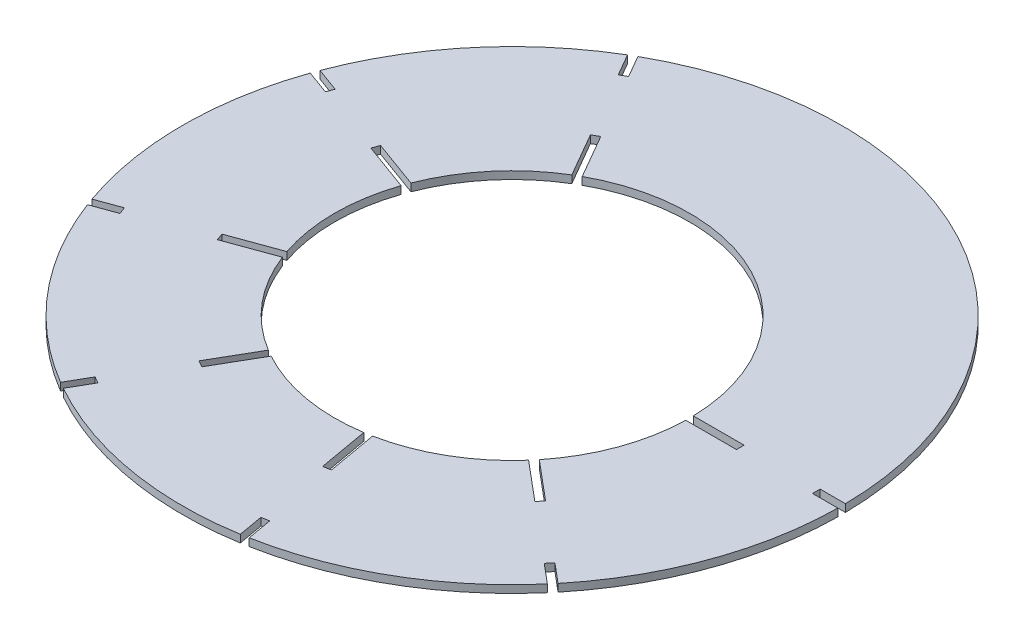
ISO-10303-21;
HEADER;
FILE_DESCRIPTION(('STEP AP214'),'2;1');
FILE_NAME('part.step','',(''),(''),'','','');
FILE_SCHEMA(('AUTOMOTIVE_DESIGN { 1 0 10303 214 1 1 1 1 }'));
ENDSEC;
DATA;
#1=APPLICATION_CONTEXT('core data for automotive mechanical design processes');
#2=APPLICATION_PROTOCOL_DEFINITION('international standard','automotive_design',2000,#1);
#3=PRODUCT_CONTEXT('',#1,'mechanical');
#4=PRODUCT('Part','Part','',(#3));
#5=PRODUCT_RELATED_PRODUCT_CATEGORY('part','',(#4));
#6=PRODUCT_DEFINITION_FORMATION('','',#4);
#7=PRODUCT_DEFINITION_CONTEXT('part definition',#1,'design');
#8=PRODUCT_DEFINITION('design','',#6,#7);
#9=PRODUCT_DEFINITION_SHAPE('','',#8);
#10=(LENGTH_UNIT() NAMED_UNIT(*) SI_UNIT(.MILLI.,.METRE.));
#11=(NAMED_UNIT(*) PLANE_ANGLE_UNIT() SI_UNIT($,.RADIAN.));
#12=(NAMED_UNIT(*) SI_UNIT($,.STERADIAN.) SOLID_ANGLE_UNIT());
#13=UNCERTAINTY_MEASURE_WITH_UNIT(LENGTH_MEASURE(1.E-05),#10,'distance_accuracy_value','');
#14=(GEOMETRIC_REPRESENTATION_CONTEXT(3) GLOBAL_UNCERTAINTY_ASSIGNED_CONTEXT((#13)) GLOBAL_UNIT_ASSIGNED_CONTEXT((#10,
#11,#12)) REPRESENTATION_CONTEXT('',''));
#15=CARTESIAN_POINT('',(0.,0.,0.));
#16=DIRECTION('',(0.,0.,1.));
#17=DIRECTION('',(1.,0.,0.));
#18=AXIS2_PLACEMENT_3D('',#15,#16,#17);
#19=CARTESIAN_POINT('',(0.,15.,0.));
#20=DIRECTION('',(0.,1.,0.));
#21=DIRECTION('',(0.,0.,1.));
#22=AXIS2_PLACEMENT_3D('',#19,#20,#21);
#23=PLANE('',#22);
#24=CARTESIAN_POINT('',(0.,15.,0.));
#25=DIRECTION('',(0.,1.,0.));
#26=DIRECTION('',(0.,0.,1.));
#27=AXIS2_PLACEMENT_3D('',#24,#25,#26);
#28=CIRCLE('',#27,350.);
#29=CARTESIAN_POINT('',(-181.455007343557,15.,-299.28929200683));
#30=VERTEX_POINT('',#29);
#31=CARTESIAN_POINT('',(-326.251746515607,15.,-126.727257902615));
#32=VERTEX_POINT('',#31);
#33=EDGE_CURVE('E773',#30,#32,#28,.T.);
#34=ORIENTED_EDGE('',*,*,#33,.F.);
#35=DIRECTION('',(-0.499999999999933,0.,-0.866025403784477));
#36=VECTOR('',#35,1.);
#37=CARTESIAN_POINT('',(-178.995190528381,15.,-295.028764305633));
#38=LINE('',#37,#36);
#39=CARTESIAN_POINT('',(-231.495190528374,15.,-385.961431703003));
#40=VERTEX_POINT('',#39);
#41=EDGE_CURVE('E511',#30,#40,#38,.T.);
#42=ORIENTED_EDGE('',*,*,#41,.T.);
#43=DIRECTION('',(0.866025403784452,0.,-0.499999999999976));
#44=VECTOR('',#43,1.);
#45=CARTESIAN_POINT('',(-231.495190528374,15.,-385.961431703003));
#46=LINE('',#45,#44);
#47=CARTESIAN_POINT('',(-218.504809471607,15.,-393.461431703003));
#48=VERTEX_POINT('',#47);
#49=EDGE_CURVE('E514',#40,#48,#46,.T.);
#50=ORIENTED_EDGE('',*,*,#49,.T.);
#51=DIRECTION('',(-0.499999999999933,0.,-0.866025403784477));
#52=VECTOR('',#51,1.);
#53=CARTESIAN_POINT('',(-166.004809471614,15.,-302.528764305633));
#54=LINE('',#53,#52);
#55=CARTESIAN_POINT('',(-168.46462628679,15.,-306.78929200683));
#56=VERTEX_POINT('',#55);
#57=EDGE_CURVE('E489',#56,#48,#54,.T.);
#58=ORIENTED_EDGE('',*,*,#57,.F.);
#59=CARTESIAN_POINT('',(349.919633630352,15.,-7.50000000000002));
#60=VERTEX_POINT('',#59);
#61=EDGE_CURVE('E769',#60,#56,#28,.T.);
#62=ORIENTED_EDGE('',*,*,#61,.F.);
#63=DIRECTION('',(1.,0.,0.));
#64=VECTOR('',#63,1.);
#65=CARTESIAN_POINT('',(345.,15.,-7.50000000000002));
#66=LINE('',#65,#64);
#67=CARTESIAN_POINT('',(450.,15.,-7.5));
#68=VERTEX_POINT('',#67);
#69=EDGE_CURVE('E644',#60,#68,#66,.T.);
#70=ORIENTED_EDGE('',*,*,#69,.T.);
#71=DIRECTION('',(0.,0.,1.));
#72=VECTOR('',#71,1.);
#73=CARTESIAN_POINT('',(450.,15.,-7.5));
#74=LINE('',#73,#72);
#75=CARTESIAN_POINT('',(450.,15.,7.5));
#76=VERTEX_POINT('',#75);
#77=EDGE_CURVE('E647',#68,#76,#74,.T.);
#78=ORIENTED_EDGE('',*,*,#77,.T.);
#79=DIRECTION('',(1.,0.,0.));
#80=VECTOR('',#79,1.);
#81=CARTESIAN_POINT('',(345.,15.,7.49999999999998));
#82=LINE('',#81,#80);
#83=CARTESIAN_POINT('',(349.919633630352,15.,7.49999999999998));
#84=VERTEX_POINT('',#83);
#85=EDGE_CURVE('E589',#84,#76,#82,.T.);
#86=ORIENTED_EDGE('',*,*,#85,.F.);
#87=CARTESIAN_POINT('',(272.874897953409,15.,219.178671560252));
#88=VERTEX_POINT('',#87);
#89=EDGE_CURVE('E772',#88,#84,#28,.T.);
#90=ORIENTED_EDGE('',*,*,#89,.F.);
#91=DIRECTION('',(0.766044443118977,0.,0.64278760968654));
#92=VECTOR('',#91,1.);
#93=CARTESIAN_POINT('',(269.106239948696,15.,216.016392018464));
#94=LINE('',#93,#92);
#95=CARTESIAN_POINT('',(349.540906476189,15.,283.509091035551));
#96=VERTEX_POINT('',#95);
#97=EDGE_CURVE('E590',#88,#96,#94,.T.);
#98=ORIENTED_EDGE('',*,*,#97,.T.);
#99=DIRECTION('',(-0.642787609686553,0.,0.766044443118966));
#100=VECTOR('',#99,1.);
#101=CARTESIAN_POINT('',(349.540906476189,15.,283.509091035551));
#102=LINE('',#101,#100);
#103=CARTESIAN_POINT('',(339.899092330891,15.,294.999757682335));
#104=VERTEX_POINT('',#103);
#105=EDGE_CURVE('E593',#96,#104,#102,.T.);
#106=ORIENTED_EDGE('',*,*,#105,.T.);
#107=DIRECTION('',(0.766044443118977,0.,0.642787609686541));
#108=VECTOR('',#107,1.);
#109=CARTESIAN_POINT('',(259.464425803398,15.,227.507058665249));
#110=LINE('',#109,#108);
#111=CARTESIAN_POINT('',(263.233083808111,15.,230.669338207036));
#112=VERTEX_POINT('',#111);
#113=EDGE_CURVE('E569',#112,#104,#110,.T.);
#114=ORIENTED_EDGE('',*,*,#113,.F.);
#115=CARTESIAN_POINT('',(68.1489648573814,15.,343.301206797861));
#116=VERTEX_POINT('',#115);
#117=EDGE_CURVE('E775',#116,#112,#28,.T.);
#118=ORIENTED_EDGE('',*,*,#117,.F.);
#119=DIRECTION('',(0.173648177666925,0.,0.984807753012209));
#120=VECTOR('',#119,1.);
#121=CARTESIAN_POINT('',(67.2946794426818,15.,338.45631345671));
#122=LINE('',#121,#120);
#123=CARTESIAN_POINT('',(85.5277380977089,15.,441.861127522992));
#124=VERTEX_POINT('',#123);
#125=EDGE_CURVE('E570',#116,#124,#122,.T.);
#126=ORIENTED_EDGE('',*,*,#125,.T.);
#127=DIRECTION('',(-0.984807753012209,0.,0.173648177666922));
#128=VECTOR('',#127,1.);
#129=CARTESIAN_POINT('',(85.5277380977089,15.,441.861127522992));
#130=LINE('',#129,#128);
#131=CARTESIAN_POINT('',(70.7556218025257,15.,444.465850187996));
#132=VERTEX_POINT('',#131);
#133=EDGE_CURVE('E573',#124,#132,#130,.T.);
#134=ORIENTED_EDGE('',*,*,#133,.T.);
#135=DIRECTION('',(0.173648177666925,0.,0.984807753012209));
#136=VECTOR('',#135,1.);
#137=CARTESIAN_POINT('',(52.5225631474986,15.,341.061036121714));
#138=LINE('',#137,#136);
#139=CARTESIAN_POINT('',(53.3768485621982,15.,345.905929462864));
#140=VERTEX_POINT('',#139);
#141=EDGE_CURVE('E547',#140,#132,#138,.T.);
#142=ORIENTED_EDGE('',*,*,#141,.F.);
#143=CARTESIAN_POINT('',(-168.464626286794,15.,306.789292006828));
#144=VERTEX_POINT('',#143);
#145=EDGE_CURVE('E681',#144,#140,#28,.T.);
#146=ORIENTED_EDGE('',*,*,#145,.F.);
#147=DIRECTION('',(-0.500000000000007,0.,0.866025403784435));
#148=VECTOR('',#147,1.);
#149=CARTESIAN_POINT('',(-166.004809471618,15.,302.528764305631));
#150=LINE('',#149,#148);
#151=CARTESIAN_POINT('',(-218.504809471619,15.,393.461431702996));
#152=VERTEX_POINT('',#151);
#153=EDGE_CURVE('E548',#144,#152,#150,.T.);
#154=ORIENTED_EDGE('',*,*,#153,.T.);
#155=DIRECTION('',(-0.866025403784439,0.,-0.5));
#156=VECTOR('',#155,1.);
#157=CARTESIAN_POINT('',(-218.504809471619,15.,393.461431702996));
#158=LINE('',#157,#156);
#159=CARTESIAN_POINT('',(-231.495190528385,15.,385.961431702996));
#160=VERTEX_POINT('',#159);
#161=EDGE_CURVE('E551',#152,#160,#158,.T.);
#162=ORIENTED_EDGE('',*,*,#161,.T.);
#163=DIRECTION('',(-0.500000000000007,0.,0.866025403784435));
#164=VECTOR('',#163,1.);
#165=CARTESIAN_POINT('',(-178.995190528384,15.,295.028764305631));
#166=LINE('',#165,#164);
#167=CARTESIAN_POINT('',(-181.455007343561,15.,299.289292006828));
#168=VERTEX_POINT('',#167);
#169=EDGE_CURVE('E555',#168,#160,#166,.T.);
#170=ORIENTED_EDGE('',*,*,#169,.F.);
#171=CARTESIAN_POINT('',(-326.251746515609,15.,126.727257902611));
#172=VERTEX_POINT('',#171);
#173=EDGE_CURVE('E677',#172,#168,#28,.T.);
#174=ORIENTED_EDGE('',*,*,#173,.F.);
#175=DIRECTION('',(-0.939692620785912,0.,0.342020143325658));
#176=VECTOR('',#175,1.);
#177=CARTESIAN_POINT('',(-321.628803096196,15.,125.044644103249));
#178=LINE('',#177,#176);
#179=CARTESIAN_POINT('',(-420.296528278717,15.,160.956759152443));
#180=VERTEX_POINT('',#179);
#181=EDGE_CURVE('E661',#172,#180,#178,.T.);
#182=ORIENTED_EDGE('',*,*,#181,.T.);
#183=DIRECTION('',(-0.342020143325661,0.,-0.939692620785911));
#184=VECTOR('',#183,1.);
#185=CARTESIAN_POINT('',(-420.296528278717,15.,160.956759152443));
#186=LINE('',#185,#184);
#187=CARTESIAN_POINT('',(-425.426830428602,15.,146.861369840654));
#188=VERTEX_POINT('',#187);
#189=EDGE_CURVE('E667',#180,#188,#186,.T.);
#190=ORIENTED_EDGE('',*,*,#189,.T.);
#191=DIRECTION('',(-0.939692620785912,0.,0.342020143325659));
#192=VECTOR('',#191,1.);
#193=CARTESIAN_POINT('',(-326.759105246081,15.,110.94925479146));
#194=LINE('',#193,#192);
#195=CARTESIAN_POINT('',(-331.382048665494,15.,112.631868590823));
#196=VERTEX_POINT('',#195);
#197=EDGE_CURVE('E557',#196,#188,#194,.T.);
#198=ORIENTED_EDGE('',*,*,#197,.F.);
#199=CARTESIAN_POINT('',(-331.382048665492,15.,-112.631868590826));
#200=VERTEX_POINT('',#199);
#201=EDGE_CURVE('E682',#200,#196,#28,.T.);
#202=ORIENTED_EDGE('',*,*,#201,.F.);
#203=DIRECTION('',(-0.939692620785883,0.,-0.342020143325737));
#204=VECTOR('',#203,1.);
#205=CARTESIAN_POINT('',(-326.75910524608,15.,-110.949254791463));
#206=LINE('',#205,#204);
#207=CARTESIAN_POINT('',(-425.426830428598,15.,-146.861369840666));
#208=VERTEX_POINT('',#207);
#209=EDGE_CURVE('E610',#200,#208,#206,.T.);
#210=ORIENTED_EDGE('',*,*,#209,.T.);
#211=DIRECTION('',(0.342020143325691,0.,-0.9396926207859));
#212=VECTOR('',#211,1.);
#213=CARTESIAN_POINT('',(-425.426830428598,15.,-146.861369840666));
#214=LINE('',#213,#212);
#215=CARTESIAN_POINT('',(-420.296528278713,15.,-160.956759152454));
#216=VERTEX_POINT('',#215);
#217=EDGE_CURVE('E613',#208,#216,#214,.T.);
#218=ORIENTED_EDGE('',*,*,#217,.T.);
#219=DIRECTION('',(-0.939692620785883,0.,-0.342020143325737));
#220=VECTOR('',#219,1.);
#221=CARTESIAN_POINT('',(-321.628803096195,15.,-125.044644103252));
#222=LINE('',#221,#220);
#223=EDGE_CURVE('E616',#32,#216,#222,.T.);
#224=ORIENTED_EDGE('',*,*,#223,.F.);
#225=EDGE_LOOP('',(#34,#42,#50,#58,#62,#70,#78,#86,#90,#98,#106,#114,#118,#126,#134,#142,#146,
#154,#162,#170,#174,#182,#190,#198,#202,#210,#218,#224));
#226=FACE_BOUND('',#225,.T.);
#227=DIRECTION('',(0.866025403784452,0.,-0.499999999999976));
#228=VECTOR('',#227,1.);
#229=CARTESIAN_POINT('',(-306.495190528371,15.,-515.86524227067));
#230=LINE('',#229,#228);
#231=CARTESIAN_POINT('',(-306.495190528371,15.,-515.86524227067));
#232=VERTEX_POINT('',#231);
#233=CARTESIAN_POINT('',(-293.504809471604,15.,-523.36524227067));
#234=VERTEX_POINT('',#233);
#235=EDGE_CURVE('E510',#232,#234,#230,.T.);
#236=ORIENTED_EDGE('',*,*,#235,.F.);
#237=DIRECTION('',(-0.499999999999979,0.,-0.866025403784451));
#238=VECTOR('',#237,1.);
#239=CARTESIAN_POINT('',(-306.495190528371,15.,-515.86524227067));
#240=LINE('',#239,#238);
#241=CARTESIAN_POINT('',(-331.47355519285,15.,-559.129038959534));
#242=VERTEX_POINT('',#241);
#243=EDGE_CURVE('E527',#232,#242,#240,.T.);
#244=ORIENTED_EDGE('',*,*,#243,.T.);
#245=CARTESIAN_POINT('',(0.,15.,0.));
#246=DIRECTION('',(0.,1.,0.));
#247=DIRECTION('',(0.,0.,1.));
#248=AXIS2_PLACEMENT_3D('',#245,#246,#247);
#249=CIRCLE('',#248,650.);
#250=CARTESIAN_POINT('',(-608.194391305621,15.,-229.345988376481));
#251=VERTEX_POINT('',#250);
#252=EDGE_CURVE('E1419',#242,#251,#249,.T.);
#253=ORIENTED_EDGE('',*,*,#252,.T.);
#254=DIRECTION('',(-0.939692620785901,0.,-0.342020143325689));
#255=VECTOR('',#254,1.);
#256=CARTESIAN_POINT('',(-561.250421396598,15.,-212.259780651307));
#257=LINE('',#256,#255);
#258=CARTESIAN_POINT('',(-561.250421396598,15.,-212.259780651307));
#259=VERTEX_POINT('',#258);
#260=EDGE_CURVE('E493',#259,#251,#257,.T.);
#261=ORIENTED_EDGE('',*,*,#260,.F.);
#262=DIRECTION('',(0.342020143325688,0.,-0.939692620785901));
#263=VECTOR('',#262,1.);
#264=CARTESIAN_POINT('',(-566.380723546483,15.,-198.164391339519));
#265=LINE('',#264,#263);
#266=CARTESIAN_POINT('',(-566.380723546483,15.,-198.164391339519));
#267=VERTEX_POINT('',#266);
#268=EDGE_CURVE('E469',#267,#259,#265,.T.);
#269=ORIENTED_EDGE('',*,*,#268,.F.);
#270=DIRECTION('',(-0.939692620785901,0.,-0.342020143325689));
#271=VECTOR('',#270,1.);
#272=CARTESIAN_POINT('',(-566.380723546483,15.,-198.164391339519));
#273=LINE('',#272,#271);
#274=CARTESIAN_POINT('',(-613.324693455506,15.,-215.250599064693));
#275=VERTEX_POINT('',#274);
#276=EDGE_CURVE('E490',#267,#275,#273,.T.);
#277=ORIENTED_EDGE('',*,*,#276,.T.);
#278=CARTESIAN_POINT('',(-613.324693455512,15.,215.250599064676));
#279=VERTEX_POINT('',#278);
#280=EDGE_CURVE('E1417',#275,#279,#249,.T.);
#281=ORIENTED_EDGE('',*,*,#280,.T.);
#282=DIRECTION('',(-0.93969262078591,0.,0.342020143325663));
#283=VECTOR('',#282,1.);
#284=CARTESIAN_POINT('',(-566.380723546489,15.,198.164391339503));
#285=LINE('',#284,#283);
#286=CARTESIAN_POINT('',(-566.380723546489,15.,198.164391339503));
#287=VERTEX_POINT('',#286);
#288=EDGE_CURVE('E473',#287,#279,#285,.T.);
#289=ORIENTED_EDGE('',*,*,#288,.F.);
#290=DIRECTION('',(-0.342020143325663,0.,-0.939692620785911));
#291=VECTOR('',#290,1.);
#292=CARTESIAN_POINT('',(-561.250421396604,15.,212.259780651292));
#293=LINE('',#292,#291);
#294=CARTESIAN_POINT('',(-561.250421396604,15.,212.259780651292));
#295=VERTEX_POINT('',#294);
#296=EDGE_CURVE('E449',#295,#287,#293,.T.);
#297=ORIENTED_EDGE('',*,*,#296,.F.);
#298=DIRECTION('',(-0.939692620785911,0.,0.342020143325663));
#299=VECTOR('',#298,1.);
#300=CARTESIAN_POINT('',(-561.250421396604,15.,212.259780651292));
#301=LINE('',#300,#299);
#302=CARTESIAN_POINT('',(-608.194391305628,15.,229.345988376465));
#303=VERTEX_POINT('',#302);
#304=EDGE_CURVE('E470',#295,#303,#301,.T.);
#305=ORIENTED_EDGE('',*,*,#304,.T.);
#306=CARTESIAN_POINT('',(-331.473555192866,15.,559.129038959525));
#307=VERTEX_POINT('',#306);
#308=EDGE_CURVE('E690',#303,#307,#249,.T.);
#309=ORIENTED_EDGE('',*,*,#308,.T.);
#310=DIRECTION('',(-0.500000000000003,0.,0.866025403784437));
#311=VECTOR('',#310,1.);
#312=CARTESIAN_POINT('',(-306.495190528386,15.,515.865242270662));
#313=LINE('',#312,#311);
#314=CARTESIAN_POINT('',(-306.495190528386,15.,515.865242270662));
#315=VERTEX_POINT('',#314);
#316=EDGE_CURVE('E453',#315,#307,#313,.T.);
#317=ORIENTED_EDGE('',*,*,#316,.F.);
#318=DIRECTION('',(-0.866025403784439,0.,-0.499999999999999));
#319=VECTOR('',#318,1.);
#320=CARTESIAN_POINT('',(-293.504809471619,15.,523.365242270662));
#321=LINE('',#320,#319);
#322=CARTESIAN_POINT('',(-293.504809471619,15.,523.365242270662));
#323=VERTEX_POINT('',#322);
#324=EDGE_CURVE('E429',#323,#315,#321,.T.);
#325=ORIENTED_EDGE('',*,*,#324,.F.);
#326=DIRECTION('',(-0.500000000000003,0.,0.866025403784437));
#327=VECTOR('',#326,1.);
#328=CARTESIAN_POINT('',(-293.504809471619,15.,523.365242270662));
#329=LINE('',#328,#327);
#330=CARTESIAN_POINT('',(-318.4831741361,15.,566.629038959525));
#331=VERTEX_POINT('',#330);
#332=EDGE_CURVE('E450',#323,#331,#329,.T.);
#333=ORIENTED_EDGE('',*,*,#332,.T.);
#334=CARTESIAN_POINT('',(105.477743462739,15.,641.38478749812));
#335=VERTEX_POINT('',#334);
#336=EDGE_CURVE('E687',#331,#335,#249,.T.);
#337=ORIENTED_EDGE('',*,*,#336,.T.);
#338=DIRECTION('',(0.173648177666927,0.,0.984807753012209));
#339=VECTOR('',#338,1.);
#340=CARTESIAN_POINT('',(96.8028484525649,15.,592.187013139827));
#341=LINE('',#340,#339);
#342=CARTESIAN_POINT('',(96.8028484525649,15.,592.187013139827));
#343=VERTEX_POINT('',#342);
#344=EDGE_CURVE('E433',#343,#335,#341,.T.);
#345=ORIENTED_EDGE('',*,*,#344,.F.);
#346=DIRECTION('',(-0.984807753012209,0.,0.173648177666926));
#347=VECTOR('',#346,1.);
#348=CARTESIAN_POINT('',(111.574964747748,15.,589.582290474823));
#349=LINE('',#348,#347);
#350=CARTESIAN_POINT('',(111.574964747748,15.,589.582290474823));
#351=VERTEX_POINT('',#350);
#352=EDGE_CURVE('E398',#351,#343,#349,.T.);
#353=ORIENTED_EDGE('',*,*,#352,.F.);
#354=DIRECTION('',(0.173648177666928,0.,0.984807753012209));
#355=VECTOR('',#354,1.);
#356=CARTESIAN_POINT('',(111.574964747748,15.,589.582290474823));
#357=LINE('',#356,#355);
#358=CARTESIAN_POINT('',(120.249859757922,15.,638.780064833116));
#359=VERTEX_POINT('',#358);
#360=EDGE_CURVE('E430',#351,#359,#357,.T.);
#361=ORIENTED_EDGE('',*,*,#360,.T.);
#362=CARTESIAN_POINT('',(493.074833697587,15.,423.529465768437));
#363=VERTEX_POINT('',#362);
#364=EDGE_CURVE('E692',#359,#363,#249,.T.);
#365=ORIENTED_EDGE('',*,*,#364,.T.);
#366=DIRECTION('',(0.766044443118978,0.,0.642787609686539));
#367=VECTOR('',#366,1.);
#368=CARTESIAN_POINT('',(454.805758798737,15.,391.417899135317));
#369=LINE('',#368,#367);
#370=CARTESIAN_POINT('',(454.805758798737,15.,391.417899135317));
#371=VERTEX_POINT('',#370);
#372=EDGE_CURVE('E408',#371,#363,#369,.T.);
#373=ORIENTED_EDGE('',*,*,#372,.F.);
#374=DIRECTION('',(-0.642787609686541,0.,0.766044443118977));
#375=VECTOR('',#374,1.);
#376=CARTESIAN_POINT('',(464.447572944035,15.,379.927232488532));
#377=LINE('',#376,#375);
#378=CARTESIAN_POINT('',(464.447572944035,15.,379.927232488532));
#379=VERTEX_POINT('',#378);
#380=EDGE_CURVE('E391',#379,#371,#377,.T.);
#381=ORIENTED_EDGE('',*,*,#380,.F.);
#382=DIRECTION('',(0.766044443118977,0.,0.64278760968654));
#383=VECTOR('',#382,1.);
#384=CARTESIAN_POINT('',(464.447572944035,15.,379.927232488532));
#385=LINE('',#384,#383);
#386=CARTESIAN_POINT('',(502.716647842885,15.,412.038799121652));
#387=VERTEX_POINT('',#386);
#388=EDGE_CURVE('E401',#379,#387,#385,.T.);
#389=ORIENTED_EDGE('',*,*,#388,.T.);
#390=CARTESIAN_POINT('',(649.956729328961,15.,7.5));
#391=VERTEX_POINT('',#390);
#392=EDGE_CURVE('E1426',#387,#391,#249,.T.);
#393=ORIENTED_EDGE('',*,*,#392,.T.);
#394=DIRECTION('',(1.,0.,0.));
#395=VECTOR('',#394,1.);
#396=CARTESIAN_POINT('',(600.,15.,7.5));
#397=LINE('',#396,#395);
#398=CARTESIAN_POINT('',(600.,15.,7.5));
#399=VERTEX_POINT('',#398);
#400=EDGE_CURVE('E628',#399,#391,#397,.T.);
#401=ORIENTED_EDGE('',*,*,#400,.F.);
#402=DIRECTION('',(0.,0.,1.));
#403=VECTOR('',#402,1.);
#404=CARTESIAN_POINT('',(600.,15.,-7.5));
#405=LINE('',#404,#403);
#406=CARTESIAN_POINT('',(600.,15.,-7.5));
#407=VERTEX_POINT('',#406);
#408=EDGE_CURVE('E609',#407,#399,#405,.T.);
#409=ORIENTED_EDGE('',*,*,#408,.F.);
#410=DIRECTION('',(1.,0.,0.));
#411=VECTOR('',#410,1.);
#412=CARTESIAN_POINT('',(600.,15.,-7.5));
#413=LINE('',#412,#411);
#414=CARTESIAN_POINT('',(649.956729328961,15.,-7.5));
#415=VERTEX_POINT('',#414);
#416=EDGE_CURVE('E625',#407,#415,#413,.T.);
#417=ORIENTED_EDGE('',*,*,#416,.T.);
#418=CARTESIAN_POINT('',(-318.483174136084,15.,-566.629038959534));
#419=VERTEX_POINT('',#418);
#420=EDGE_CURVE('E1423',#415,#419,#249,.T.);
#421=ORIENTED_EDGE('',*,*,#420,.T.);
#422=DIRECTION('',(-0.49999999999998,0.,-0.86602540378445));
#423=VECTOR('',#422,1.);
#424=CARTESIAN_POINT('',(-293.504809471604,15.,-523.36524227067));
#425=LINE('',#424,#423);
#426=EDGE_CURVE('E530',#234,#419,#425,.T.);
#427=ORIENTED_EDGE('',*,*,#426,.F.);
#428=EDGE_LOOP('',(#236,#244,#253,#261,#269,#277,#281,#289,#297,#305,#309,#317,#325,#333,#337,
#345,#353,#361,#365,#373,#381,#389,#393,#401,#409,#417,#421,#427));
#429=FACE_BOUND('',#428,.T.);
#430=ADVANCED_FACE('F32',(#226,#429),#23,.T.);
#431=CARTESIAN_POINT('',(0.,0.,0.));
#432=DIRECTION('',(0.,1.,0.));
#433=DIRECTION('',(0.,0.,1.));
#434=AXIS2_PLACEMENT_3D('',#431,#432,#433);
#435=PLANE('',#434);
#436=DIRECTION('',(-0.499999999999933,0.,-0.866025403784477));
#437=VECTOR('',#436,1.);
#438=CARTESIAN_POINT('',(-178.995190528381,0.,-295.028764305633));
#439=LINE('',#438,#437);
#440=CARTESIAN_POINT('',(-181.455007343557,0.,-299.28929200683));
#441=VERTEX_POINT('',#440);
#442=CARTESIAN_POINT('',(-231.495190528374,0.,-385.961431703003));
#443=VERTEX_POINT('',#442);
#444=EDGE_CURVE('E507',#441,#443,#439,.T.);
#445=ORIENTED_EDGE('',*,*,#444,.F.);
#446=CARTESIAN_POINT('',(0.,0.,0.));
#447=DIRECTION('',(0.,1.,0.));
#448=DIRECTION('',(0.,0.,1.));
#449=AXIS2_PLACEMENT_3D('',#446,#447,#448);
#450=CIRCLE('',#449,350.);
#451=CARTESIAN_POINT('',(-326.251746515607,0.,-126.727257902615));
#452=VERTEX_POINT('',#451);
#453=EDGE_CURVE('E801',#441,#452,#450,.T.);
#454=ORIENTED_EDGE('',*,*,#453,.T.);
#455=DIRECTION('',(-0.939692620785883,0.,-0.342020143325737));
#456=VECTOR('',#455,1.);
#457=CARTESIAN_POINT('',(-321.628803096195,0.,-125.044644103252));
#458=LINE('',#457,#456);
#459=CARTESIAN_POINT('',(-420.296528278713,0.,-160.956759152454));
#460=VERTEX_POINT('',#459);
#461=EDGE_CURVE('E47',#452,#460,#458,.T.);
#462=ORIENTED_EDGE('',*,*,#461,.T.);
#463=DIRECTION('',(0.342020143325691,0.,-0.9396926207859));
#464=VECTOR('',#463,1.);
#465=CARTESIAN_POINT('',(-425.426830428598,0.,-146.861369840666));
#466=LINE('',#465,#464);
#467=CARTESIAN_POINT('',(-425.426830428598,0.,-146.861369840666));
#468=VERTEX_POINT('',#467);
#469=EDGE_CURVE('E620',#468,#460,#466,.T.);
#470=ORIENTED_EDGE('',*,*,#469,.F.);
#471=DIRECTION('',(-0.939692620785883,0.,-0.342020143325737));
#472=VECTOR('',#471,1.);
#473=CARTESIAN_POINT('',(-326.75910524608,0.,-110.949254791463));
#474=LINE('',#473,#472);
#475=CARTESIAN_POINT('',(-331.382048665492,0.,-112.631868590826));
#476=VERTEX_POINT('',#475);
#477=EDGE_CURVE('E606',#476,#468,#474,.T.);
#478=ORIENTED_EDGE('',*,*,#477,.F.);
#479=CARTESIAN_POINT('',(-331.382048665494,0.,112.631868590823));
#480=VERTEX_POINT('',#479);
#481=EDGE_CURVE('E674',#476,#480,#450,.T.);
#482=ORIENTED_EDGE('',*,*,#481,.T.);
#483=DIRECTION('',(-0.939692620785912,0.,0.342020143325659));
#484=VECTOR('',#483,1.);
#485=CARTESIAN_POINT('',(-326.759105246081,0.,110.94925479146));
#486=LINE('',#485,#484);
#487=CARTESIAN_POINT('',(-425.426830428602,0.,146.861369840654));
#488=VERTEX_POINT('',#487);
#489=EDGE_CURVE('E657',#480,#488,#486,.T.);
#490=ORIENTED_EDGE('',*,*,#489,.T.);
#491=DIRECTION('',(-0.342020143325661,0.,-0.939692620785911));
#492=VECTOR('',#491,1.);
#493=CARTESIAN_POINT('',(-420.296528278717,0.,160.956759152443));
#494=LINE('',#493,#492);
#495=CARTESIAN_POINT('',(-420.296528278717,0.,160.956759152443));
#496=VERTEX_POINT('',#495);
#497=EDGE_CURVE('E660',#496,#488,#494,.T.);
#498=ORIENTED_EDGE('',*,*,#497,.F.);
#499=DIRECTION('',(-0.939692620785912,0.,0.342020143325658));
#500=VECTOR('',#499,1.);
#501=CARTESIAN_POINT('',(-321.628803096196,0.,125.044644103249));
#502=LINE('',#501,#500);
#503=CARTESIAN_POINT('',(-326.251746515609,0.,126.727257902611));
#504=VERTEX_POINT('',#503);
#505=EDGE_CURVE('E663',#504,#496,#502,.T.);
#506=ORIENTED_EDGE('',*,*,#505,.F.);
#507=CARTESIAN_POINT('',(-181.455007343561,0.,299.289292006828));
#508=VERTEX_POINT('',#507);
#509=EDGE_CURVE('E683',#504,#508,#450,.T.);
#510=ORIENTED_EDGE('',*,*,#509,.T.);
#511=DIRECTION('',(-0.500000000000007,0.,0.866025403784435));
#512=VECTOR('',#511,1.);
#513=CARTESIAN_POINT('',(-178.995190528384,0.,295.028764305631));
#514=LINE('',#513,#512);
#515=CARTESIAN_POINT('',(-231.495190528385,0.,385.961431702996));
#516=VERTEX_POINT('',#515);
#517=EDGE_CURVE('E552',#508,#516,#514,.T.);
#518=ORIENTED_EDGE('',*,*,#517,.T.);
#519=DIRECTION('',(-0.866025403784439,0.,-0.5));
#520=VECTOR('',#519,1.);
#521=CARTESIAN_POINT('',(-218.504809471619,0.,393.461431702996));
#522=LINE('',#521,#520);
#523=CARTESIAN_POINT('',(-218.504809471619,0.,393.461431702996));
#524=VERTEX_POINT('',#523);
#525=EDGE_CURVE('E559',#524,#516,#522,.T.);
#526=ORIENTED_EDGE('',*,*,#525,.F.);
#527=DIRECTION('',(-0.500000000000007,0.,0.866025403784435));
#528=VECTOR('',#527,1.);
#529=CARTESIAN_POINT('',(-166.004809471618,0.,302.528764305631));
#530=LINE('',#529,#528);
#531=CARTESIAN_POINT('',(-168.464626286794,0.,306.789292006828));
#532=VERTEX_POINT('',#531);
#533=EDGE_CURVE('E544',#532,#524,#530,.T.);
#534=ORIENTED_EDGE('',*,*,#533,.F.);
#535=CARTESIAN_POINT('',(53.3768485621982,0.,345.905929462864));
#536=VERTEX_POINT('',#535);
#537=EDGE_CURVE('E686',#532,#536,#450,.T.);
#538=ORIENTED_EDGE('',*,*,#537,.T.);
#539=DIRECTION('',(0.173648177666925,0.,0.984807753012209));
#540=VECTOR('',#539,1.);
#541=CARTESIAN_POINT('',(52.5225631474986,0.,341.061036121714));
#542=LINE('',#541,#540);
#543=CARTESIAN_POINT('',(70.7556218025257,0.,444.465850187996));
#544=VERTEX_POINT('',#543);
#545=EDGE_CURVE('E574',#536,#544,#542,.T.);
#546=ORIENTED_EDGE('',*,*,#545,.T.);
#547=DIRECTION('',(-0.984807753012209,0.,0.173648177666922));
#548=VECTOR('',#547,1.);
#549=CARTESIAN_POINT('',(85.5277380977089,0.,441.861127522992));
#550=LINE('',#549,#548);
#551=CARTESIAN_POINT('',(85.5277380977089,0.,441.861127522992));
#552=VERTEX_POINT('',#551);
#553=EDGE_CURVE('E579',#552,#544,#550,.T.);
#554=ORIENTED_EDGE('',*,*,#553,.F.);
#555=DIRECTION('',(0.173648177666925,0.,0.984807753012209));
#556=VECTOR('',#555,1.);
#557=CARTESIAN_POINT('',(67.2946794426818,0.,338.45631345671));
#558=LINE('',#557,#556);
#559=CARTESIAN_POINT('',(68.1489648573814,0.,343.301206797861));
#560=VERTEX_POINT('',#559);
#561=EDGE_CURVE('E566',#560,#552,#558,.T.);
#562=ORIENTED_EDGE('',*,*,#561,.F.);
#563=CARTESIAN_POINT('',(263.233083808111,0.,230.669338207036));
#564=VERTEX_POINT('',#563);
#565=EDGE_CURVE('E808',#560,#564,#450,.T.);
#566=ORIENTED_EDGE('',*,*,#565,.T.);
#567=DIRECTION('',(0.766044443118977,0.,0.642787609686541));
#568=VECTOR('',#567,1.);
#569=CARTESIAN_POINT('',(259.464425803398,0.,227.507058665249));
#570=LINE('',#569,#568);
#571=CARTESIAN_POINT('',(339.899092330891,0.,294.999757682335));
#572=VERTEX_POINT('',#571);
#573=EDGE_CURVE('E594',#564,#572,#570,.T.);
#574=ORIENTED_EDGE('',*,*,#573,.T.);
#575=DIRECTION('',(-0.642787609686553,0.,0.766044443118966));
#576=VECTOR('',#575,1.);
#577=CARTESIAN_POINT('',(349.540906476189,0.,283.509091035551));
#578=LINE('',#577,#576);
#579=CARTESIAN_POINT('',(349.540906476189,0.,283.509091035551));
#580=VERTEX_POINT('',#579);
#581=EDGE_CURVE('E599',#580,#572,#578,.T.);
#582=ORIENTED_EDGE('',*,*,#581,.F.);
#583=DIRECTION('',(0.766044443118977,0.,0.64278760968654));
#584=VECTOR('',#583,1.);
#585=CARTESIAN_POINT('',(269.106239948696,0.,216.016392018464));
#586=LINE('',#585,#584);
#587=CARTESIAN_POINT('',(272.874897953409,0.,219.178671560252));
#588=VERTEX_POINT('',#587);
#589=EDGE_CURVE('E586',#588,#580,#586,.T.);
#590=ORIENTED_EDGE('',*,*,#589,.F.);
#591=CARTESIAN_POINT('',(349.919633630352,0.,7.49999999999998));
#592=VERTEX_POINT('',#591);
#593=EDGE_CURVE('E805',#588,#592,#450,.T.);
#594=ORIENTED_EDGE('',*,*,#593,.T.);
#595=DIRECTION('',(1.,0.,0.));
#596=VECTOR('',#595,1.);
#597=CARTESIAN_POINT('',(345.,0.,7.49999999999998));
#598=LINE('',#597,#596);
#599=CARTESIAN_POINT('',(450.,0.,7.5));
#600=VERTEX_POINT('',#599);
#601=EDGE_CURVE('E648',#592,#600,#598,.T.);
#602=ORIENTED_EDGE('',*,*,#601,.T.);
#603=DIRECTION('',(0.,0.,1.));
#604=VECTOR('',#603,1.);
#605=CARTESIAN_POINT('',(450.,0.,-7.5));
#606=LINE('',#605,#604);
#607=CARTESIAN_POINT('',(450.,0.,-7.5));
#608=VERTEX_POINT('',#607);
#609=EDGE_CURVE('E653',#608,#600,#606,.T.);
#610=ORIENTED_EDGE('',*,*,#609,.F.);
#611=DIRECTION('',(1.,0.,0.));
#612=VECTOR('',#611,1.);
#613=CARTESIAN_POINT('',(345.,0.,-7.50000000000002));
#614=LINE('',#613,#612);
#615=CARTESIAN_POINT('',(349.919633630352,0.,-7.50000000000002));
#616=VERTEX_POINT('',#615);
#617=EDGE_CURVE('E642',#616,#608,#614,.T.);
#618=ORIENTED_EDGE('',*,*,#617,.F.);
#619=CARTESIAN_POINT('',(-168.46462628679,0.,-306.78929200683));
#620=VERTEX_POINT('',#619);
#621=EDGE_CURVE('E803',#616,#620,#450,.T.);
#622=ORIENTED_EDGE('',*,*,#621,.T.);
#623=DIRECTION('',(-0.499999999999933,0.,-0.866025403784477));
#624=VECTOR('',#623,1.);
#625=CARTESIAN_POINT('',(-166.004809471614,0.,-302.528764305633));
#626=LINE('',#625,#624);
#627=CARTESIAN_POINT('',(-218.504809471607,0.,-393.461431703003));
#628=VERTEX_POINT('',#627);
#629=EDGE_CURVE('E55',#620,#628,#626,.T.);
#630=ORIENTED_EDGE('',*,*,#629,.T.);
#631=DIRECTION('',(0.866025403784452,0.,-0.499999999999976));
#632=VECTOR('',#631,1.);
#633=CARTESIAN_POINT('',(-231.495190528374,0.,-385.961431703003));
#634=LINE('',#633,#632);
#635=EDGE_CURVE('E519',#443,#628,#634,.T.);
#636=ORIENTED_EDGE('',*,*,#635,.F.);
#637=EDGE_LOOP('',(#445,#454,#462,#470,#478,#482,#490,#498,#506,#510,#518,#526,#534,#538,#546,
#554,#562,#566,#574,#582,#590,#594,#602,#610,#618,#622,#630,#636));
#638=FACE_BOUND('',#637,.T.);
#639=DIRECTION('',(-0.499999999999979,0.,-0.866025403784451));
#640=VECTOR('',#639,1.);
#641=CARTESIAN_POINT('',(-306.495190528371,0.,-515.86524227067));
#642=LINE('',#641,#640);
#643=CARTESIAN_POINT('',(-306.495190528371,0.,-515.86524227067));
#644=VERTEX_POINT('',#643);
#645=CARTESIAN_POINT('',(-331.47355519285,0.,-559.129038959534));
#646=VERTEX_POINT('',#645);
#647=EDGE_CURVE('E524',#644,#646,#642,.T.);
#648=ORIENTED_EDGE('',*,*,#647,.F.);
#649=DIRECTION('',(0.866025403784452,0.,-0.499999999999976));
#650=VECTOR('',#649,1.);
#651=CARTESIAN_POINT('',(-306.495190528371,0.,-515.86524227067));
#652=LINE('',#651,#650);
#653=CARTESIAN_POINT('',(-293.504809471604,0.,-523.36524227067));
#654=VERTEX_POINT('',#653);
#655=EDGE_CURVE('E531',#644,#654,#652,.T.);
#656=ORIENTED_EDGE('',*,*,#655,.T.);
#657=DIRECTION('',(-0.49999999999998,0.,-0.86602540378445));
#658=VECTOR('',#657,1.);
#659=CARTESIAN_POINT('',(-293.504809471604,0.,-523.36524227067));
#660=LINE('',#659,#658);
#661=CARTESIAN_POINT('',(-318.483174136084,0.,-566.629038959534));
#662=VERTEX_POINT('',#661);
#663=EDGE_CURVE('E536',#654,#662,#660,.T.);
#664=ORIENTED_EDGE('',*,*,#663,.T.);
#665=CARTESIAN_POINT('',(0.,0.,0.));
#666=DIRECTION('',(0.,1.,0.));
#667=DIRECTION('',(0.,0.,1.));
#668=AXIS2_PLACEMENT_3D('',#665,#666,#667);
#669=CIRCLE('',#668,650.);
#670=CARTESIAN_POINT('',(649.956729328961,0.,-7.5));
#671=VERTEX_POINT('',#670);
#672=EDGE_CURVE('E1389',#671,#662,#669,.T.);
#673=ORIENTED_EDGE('',*,*,#672,.F.);
#674=DIRECTION('',(1.,0.,0.));
#675=VECTOR('',#674,1.);
#676=CARTESIAN_POINT('',(600.,0.,-7.5));
#677=LINE('',#676,#675);
#678=CARTESIAN_POINT('',(600.,0.,-7.5));
#679=VERTEX_POINT('',#678);
#680=EDGE_CURVE('E623',#679,#671,#677,.T.);
#681=ORIENTED_EDGE('',*,*,#680,.F.);
#682=DIRECTION('',(0.,0.,1.));
#683=VECTOR('',#682,1.);
#684=CARTESIAN_POINT('',(600.,0.,-7.5));
#685=LINE('',#684,#683);
#686=CARTESIAN_POINT('',(600.,0.,7.5));
#687=VERTEX_POINT('',#686);
#688=EDGE_CURVE('E629',#679,#687,#685,.T.);
#689=ORIENTED_EDGE('',*,*,#688,.T.);
#690=DIRECTION('',(1.,0.,0.));
#691=VECTOR('',#690,1.);
#692=CARTESIAN_POINT('',(600.,0.,7.5));
#693=LINE('',#692,#691);
#694=CARTESIAN_POINT('',(649.956729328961,0.,7.5));
#695=VERTEX_POINT('',#694);
#696=EDGE_CURVE('E634',#687,#695,#693,.T.);
#697=ORIENTED_EDGE('',*,*,#696,.T.);
#698=CARTESIAN_POINT('',(502.716647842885,0.,412.038799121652));
#699=VERTEX_POINT('',#698);
#700=EDGE_CURVE('E1393',#699,#695,#669,.T.);
#701=ORIENTED_EDGE('',*,*,#700,.F.);
#702=DIRECTION('',(0.766044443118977,0.,0.64278760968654));
#703=VECTOR('',#702,1.);
#704=CARTESIAN_POINT('',(464.447572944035,0.,379.927232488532));
#705=LINE('',#704,#703);
#706=CARTESIAN_POINT('',(464.447572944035,0.,379.927232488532));
#707=VERTEX_POINT('',#706);
#708=EDGE_CURVE('E418',#707,#699,#705,.T.);
#709=ORIENTED_EDGE('',*,*,#708,.F.);
#710=DIRECTION('',(-0.642787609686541,0.,0.766044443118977));
#711=VECTOR('',#710,1.);
#712=CARTESIAN_POINT('',(464.447572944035,0.,379.927232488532));
#713=LINE('',#712,#711);
#714=CARTESIAN_POINT('',(454.805758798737,0.,391.417899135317));
#715=VERTEX_POINT('',#714);
#716=EDGE_CURVE('E394',#707,#715,#713,.T.);
#717=ORIENTED_EDGE('',*,*,#716,.T.);
#718=DIRECTION('',(0.766044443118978,0.,0.642787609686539));
#719=VECTOR('',#718,1.);
#720=CARTESIAN_POINT('',(454.805758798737,0.,391.417899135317));
#721=LINE('',#720,#719);
#722=CARTESIAN_POINT('',(493.074833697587,0.,423.529465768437));
#723=VERTEX_POINT('',#722);
#724=EDGE_CURVE('E420',#715,#723,#721,.T.);
#725=ORIENTED_EDGE('',*,*,#724,.T.);
#726=CARTESIAN_POINT('',(120.249859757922,0.,638.780064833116));
#727=VERTEX_POINT('',#726);
#728=EDGE_CURVE('E691',#727,#723,#669,.T.);
#729=ORIENTED_EDGE('',*,*,#728,.F.);
#730=DIRECTION('',(0.173648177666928,0.,0.984807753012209));
#731=VECTOR('',#730,1.);
#732=CARTESIAN_POINT('',(111.574964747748,0.,589.582290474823));
#733=LINE('',#732,#731);
#734=CARTESIAN_POINT('',(111.574964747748,0.,589.582290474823));
#735=VERTEX_POINT('',#734);
#736=EDGE_CURVE('E426',#735,#727,#733,.T.);
#737=ORIENTED_EDGE('',*,*,#736,.F.);
#738=DIRECTION('',(-0.984807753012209,0.,0.173648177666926));
#739=VECTOR('',#738,1.);
#740=CARTESIAN_POINT('',(111.574964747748,0.,589.582290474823));
#741=LINE('',#740,#739);
#742=CARTESIAN_POINT('',(96.8028484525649,0.,592.187013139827));
#743=VERTEX_POINT('',#742);
#744=EDGE_CURVE('E434',#735,#743,#741,.T.);
#745=ORIENTED_EDGE('',*,*,#744,.T.);
#746=DIRECTION('',(0.173648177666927,0.,0.984807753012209));
#747=VECTOR('',#746,1.);
#748=CARTESIAN_POINT('',(96.8028484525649,0.,592.187013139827));
#749=LINE('',#748,#747);
#750=CARTESIAN_POINT('',(105.477743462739,0.,641.38478749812));
#751=VERTEX_POINT('',#750);
#752=EDGE_CURVE('E439',#743,#751,#749,.T.);
#753=ORIENTED_EDGE('',*,*,#752,.T.);
#754=CARTESIAN_POINT('',(-318.4831741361,0.,566.629038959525));
#755=VERTEX_POINT('',#754);
#756=EDGE_CURVE('E680',#755,#751,#669,.T.);
#757=ORIENTED_EDGE('',*,*,#756,.F.);
#758=DIRECTION('',(-0.500000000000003,0.,0.866025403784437));
#759=VECTOR('',#758,1.);
#760=CARTESIAN_POINT('',(-293.504809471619,0.,523.365242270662));
#761=LINE('',#760,#759);
#762=CARTESIAN_POINT('',(-293.504809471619,0.,523.365242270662));
#763=VERTEX_POINT('',#762);
#764=EDGE_CURVE('E446',#763,#755,#761,.T.);
#765=ORIENTED_EDGE('',*,*,#764,.F.);
#766=DIRECTION('',(-0.866025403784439,0.,-0.499999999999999));
#767=VECTOR('',#766,1.);
#768=CARTESIAN_POINT('',(-293.504809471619,0.,523.365242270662));
#769=LINE('',#768,#767);
#770=CARTESIAN_POINT('',(-306.495190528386,0.,515.865242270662));
#771=VERTEX_POINT('',#770);
#772=EDGE_CURVE('E454',#763,#771,#769,.T.);
#773=ORIENTED_EDGE('',*,*,#772,.T.);
#774=DIRECTION('',(-0.500000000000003,0.,0.866025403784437));
#775=VECTOR('',#774,1.);
#776=CARTESIAN_POINT('',(-306.495190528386,0.,515.865242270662));
#777=LINE('',#776,#775);
#778=CARTESIAN_POINT('',(-331.473555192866,0.,559.129038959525));
#779=VERTEX_POINT('',#778);
#780=EDGE_CURVE('E459',#771,#779,#777,.T.);
#781=ORIENTED_EDGE('',*,*,#780,.T.);
#782=CARTESIAN_POINT('',(-608.194391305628,0.,229.345988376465));
#783=VERTEX_POINT('',#782);
#784=EDGE_CURVE('E695',#783,#779,#669,.T.);
#785=ORIENTED_EDGE('',*,*,#784,.F.);
#786=DIRECTION('',(-0.939692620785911,0.,0.342020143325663));
#787=VECTOR('',#786,1.);
#788=CARTESIAN_POINT('',(-561.250421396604,0.,212.259780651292));
#789=LINE('',#788,#787);
#790=CARTESIAN_POINT('',(-561.250421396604,0.,212.259780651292));
#791=VERTEX_POINT('',#790);
#792=EDGE_CURVE('E466',#791,#783,#789,.T.);
#793=ORIENTED_EDGE('',*,*,#792,.F.);
#794=DIRECTION('',(-0.342020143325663,0.,-0.939692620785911));
#795=VECTOR('',#794,1.);
#796=CARTESIAN_POINT('',(-561.250421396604,0.,212.259780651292));
#797=LINE('',#796,#795);
#798=CARTESIAN_POINT('',(-566.380723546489,0.,198.164391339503));
#799=VERTEX_POINT('',#798);
#800=EDGE_CURVE('E474',#791,#799,#797,.T.);
#801=ORIENTED_EDGE('',*,*,#800,.T.);
#802=DIRECTION('',(-0.93969262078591,0.,0.342020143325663));
#803=VECTOR('',#802,1.);
#804=CARTESIAN_POINT('',(-566.380723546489,0.,198.164391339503));
#805=LINE('',#804,#803);
#806=CARTESIAN_POINT('',(-613.324693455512,0.,215.250599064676));
#807=VERTEX_POINT('',#806);
#808=EDGE_CURVE('E479',#799,#807,#805,.T.);
#809=ORIENTED_EDGE('',*,*,#808,.T.);
#810=CARTESIAN_POINT('',(-613.324693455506,0.,-215.250599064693));
#811=VERTEX_POINT('',#810);
#812=EDGE_CURVE('E1397',#811,#807,#669,.T.);
#813=ORIENTED_EDGE('',*,*,#812,.F.);
#814=DIRECTION('',(-0.939692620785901,0.,-0.342020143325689));
#815=VECTOR('',#814,1.);
#816=CARTESIAN_POINT('',(-566.380723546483,0.,-198.164391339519));
#817=LINE('',#816,#815);
#818=CARTESIAN_POINT('',(-566.380723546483,0.,-198.164391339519));
#819=VERTEX_POINT('',#818);
#820=EDGE_CURVE('E486',#819,#811,#817,.T.);
#821=ORIENTED_EDGE('',*,*,#820,.F.);
#822=DIRECTION('',(0.342020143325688,0.,-0.939692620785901));
#823=VECTOR('',#822,1.);
#824=CARTESIAN_POINT('',(-566.380723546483,0.,-198.164391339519));
#825=LINE('',#824,#823);
#826=CARTESIAN_POINT('',(-561.250421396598,0.,-212.259780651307));
#827=VERTEX_POINT('',#826);
#828=EDGE_CURVE('E494',#819,#827,#825,.T.);
#829=ORIENTED_EDGE('',*,*,#828,.T.);
#830=DIRECTION('',(-0.939692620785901,0.,-0.342020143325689));
#831=VECTOR('',#830,1.);
#832=CARTESIAN_POINT('',(-561.250421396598,0.,-212.259780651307));
#833=LINE('',#832,#831);
#834=CARTESIAN_POINT('',(-608.194391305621,0.,-229.345988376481));
#835=VERTEX_POINT('',#834);
#836=EDGE_CURVE('E499',#827,#835,#833,.T.);
#837=ORIENTED_EDGE('',*,*,#836,.T.);
#838=EDGE_CURVE('E1394',#646,#835,#669,.T.);
#839=ORIENTED_EDGE('',*,*,#838,.F.);
#840=EDGE_LOOP('',(#648,#656,#664,#673,#681,#689,#697,#701,#709,#717,#725,#729,#737,#745,#753,
#757,#765,#773,#781,#785,#793,#801,#809,#813,#821,#829,#837,#839));
#841=FACE_BOUND('',#840,.T.);
#842=ADVANCED_FACE('F796',(#638,#841),#435,.F.);
#843=CARTESIAN_POINT('',(0.,15.,0.));
#844=DIRECTION('',(0.,-1.,0.));
#845=DIRECTION('',(0.,0.,-1.));
#846=AXIS2_PLACEMENT_3D('',#843,#844,#845);
#847=CYLINDRICAL_SURFACE('',#846,350.);
#848=ORIENTED_EDGE('',*,*,#453,.F.);
#849=DIRECTION('',(0.,-1.,0.));
#850=VECTOR('',#849,1.);
#851=CARTESIAN_POINT('',(-181.455007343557,15.,-299.28929200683));
#852=LINE('',#851,#850);
#853=EDGE_CURVE('E11',#441,#30,#852,.F.);
#854=ORIENTED_EDGE('',*,*,#853,.T.);
#855=ORIENTED_EDGE('',*,*,#33,.T.);
#856=DIRECTION('',(0.,-1.,0.));
#857=VECTOR('',#856,1.);
#858=CARTESIAN_POINT('',(-326.251746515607,15.,-126.727257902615));
#859=LINE('',#858,#857);
#860=EDGE_CURVE('E751',#452,#32,#859,.F.);
#861=ORIENTED_EDGE('',*,*,#860,.F.);
#862=EDGE_LOOP('',(#848,#854,#855,#861));
#863=FACE_BOUND('',#862,.T.);
#864=ADVANCED_FACE('F879',(#863),#847,.F.);
#865=DIRECTION('',(0.,-1.,0.));
#866=VECTOR('',#865,1.);
#867=CARTESIAN_POINT('',(-168.46462628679,15.,-306.78929200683));
#868=LINE('',#867,#866);
#869=EDGE_CURVE('E40',#620,#56,#868,.F.);
#870=ORIENTED_EDGE('',*,*,#869,.F.);
#871=ORIENTED_EDGE('',*,*,#621,.F.);
#872=DIRECTION('',(0.,-1.,0.));
#873=VECTOR('',#872,1.);
#874=CARTESIAN_POINT('',(349.919633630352,15.,-7.50000000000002));
#875=LINE('',#874,#873);
#876=EDGE_CURVE('E758',#616,#60,#875,.F.);
#877=ORIENTED_EDGE('',*,*,#876,.T.);
#878=ORIENTED_EDGE('',*,*,#61,.T.);
#879=EDGE_LOOP('',(#870,#871,#877,#878));
#880=FACE_BOUND('',#879,.T.);
#881=ADVANCED_FACE('F771',(#880),#847,.F.);
#882=ORIENTED_EDGE('',*,*,#481,.F.);
#883=DIRECTION('',(0.,-1.,0.));
#884=VECTOR('',#883,1.);
#885=CARTESIAN_POINT('',(-331.382048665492,15.,-112.631868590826));
#886=LINE('',#885,#884);
#887=EDGE_CURVE('E753',#476,#200,#886,.F.);
#888=ORIENTED_EDGE('',*,*,#887,.T.);
#889=ORIENTED_EDGE('',*,*,#201,.T.);
#890=DIRECTION('',(0.,-1.,0.));
#891=VECTOR('',#890,1.);
#892=CARTESIAN_POINT('',(-331.382048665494,15.,112.631868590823));
#893=LINE('',#892,#891);
#894=EDGE_CURVE('E696',#480,#196,#893,.F.);
#895=ORIENTED_EDGE('',*,*,#894,.F.);
#896=EDGE_LOOP('',(#882,#888,#889,#895));
#897=FACE_BOUND('',#896,.T.);
#898=ADVANCED_FACE('F782',(#897),#847,.F.);
#899=DIRECTION('',(0.,-1.,0.));
#900=VECTOR('',#899,1.);
#901=CARTESIAN_POINT('',(349.919633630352,15.,7.49999999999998));
#902=LINE('',#901,#900);
#903=EDGE_CURVE('E756',#592,#84,#902,.F.);
#904=ORIENTED_EDGE('',*,*,#903,.F.);
#905=ORIENTED_EDGE('',*,*,#593,.F.);
#906=DIRECTION('',(0.,-1.,0.));
#907=VECTOR('',#906,1.);
#908=CARTESIAN_POINT('',(272.874897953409,15.,219.178671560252));
#909=LINE('',#908,#907);
#910=EDGE_CURVE('E748',#588,#88,#909,.F.);
#911=ORIENTED_EDGE('',*,*,#910,.T.);
#912=ORIENTED_EDGE('',*,*,#89,.T.);
#913=EDGE_LOOP('',(#904,#905,#911,#912));
#914=FACE_BOUND('',#913,.T.);
#915=ADVANCED_FACE('F851',(#914),#847,.F.);
#916=DIRECTION('',(0.,-1.,0.));
#917=VECTOR('',#916,1.);
#918=CARTESIAN_POINT('',(263.233083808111,15.,230.669338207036));
#919=LINE('',#918,#917);
#920=EDGE_CURVE('E746',#564,#112,#919,.F.);
#921=ORIENTED_EDGE('',*,*,#920,.F.);
#922=ORIENTED_EDGE('',*,*,#565,.F.);
#923=DIRECTION('',(0.,-1.,0.));
#924=VECTOR('',#923,1.);
#925=CARTESIAN_POINT('',(68.1489648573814,15.,343.30120679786));
#926=LINE('',#925,#924);
#927=EDGE_CURVE('E743',#560,#116,#926,.F.);
#928=ORIENTED_EDGE('',*,*,#927,.T.);
#929=ORIENTED_EDGE('',*,*,#117,.T.);
#930=EDGE_LOOP('',(#921,#922,#928,#929));
#931=FACE_BOUND('',#930,.T.);
#932=ADVANCED_FACE('F836',(#931),#847,.F.);
#933=DIRECTION('',(0.,-1.,0.));
#934=VECTOR('',#933,1.);
#935=CARTESIAN_POINT('',(53.3768485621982,15.,345.905929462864));
#936=LINE('',#935,#934);
#937=EDGE_CURVE('E741',#536,#140,#936,.F.);
#938=ORIENTED_EDGE('',*,*,#937,.F.);
#939=ORIENTED_EDGE('',*,*,#537,.F.);
#940=DIRECTION('',(0.,-1.,0.));
#941=VECTOR('',#940,1.);
#942=CARTESIAN_POINT('',(-168.464626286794,15.,306.789292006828));
#943=LINE('',#942,#941);
#944=EDGE_CURVE('E738',#532,#144,#943,.F.);
#945=ORIENTED_EDGE('',*,*,#944,.T.);
#946=ORIENTED_EDGE('',*,*,#145,.T.);
#947=EDGE_LOOP('',(#938,#939,#945,#946));
#948=FACE_BOUND('',#947,.T.);
#949=ADVANCED_FACE('F821',(#948),#847,.F.);
#950=CARTESIAN_POINT('',(0.,15.,0.));
#951=DIRECTION('',(0.,-1.,0.));
#952=DIRECTION('',(0.,0.,-1.));
#953=AXIS2_PLACEMENT_3D('',#950,#951,#952);
#954=CYLINDRICAL_SURFACE('',#953,650.);
#955=DIRECTION('',(0.,-1.,0.));
#956=VECTOR('',#955,1.);
#957=CARTESIAN_POINT('',(-331.47355519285,15.,-559.129038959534));
#958=LINE('',#957,#956);
#959=EDGE_CURVE('E734',#646,#242,#958,.F.);
#960=ORIENTED_EDGE('',*,*,#959,.F.);
#961=ORIENTED_EDGE('',*,*,#838,.T.);
#962=DIRECTION('',(0.,-1.,0.));
#963=VECTOR('',#962,1.);
#964=CARTESIAN_POINT('',(-608.194391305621,15.,-229.345988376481));
#965=LINE('',#964,#963);
#966=EDGE_CURVE('E726',#835,#251,#965,.F.);
#967=ORIENTED_EDGE('',*,*,#966,.T.);
#968=ORIENTED_EDGE('',*,*,#252,.F.);
#969=EDGE_LOOP('',(#960,#961,#967,#968));
#970=FACE_BOUND('',#969,.T.);
#971=ADVANCED_FACE('F34',(#970),#954,.T.);
#972=DIRECTION('',(0.,-1.,0.));
#973=VECTOR('',#972,1.);
#974=CARTESIAN_POINT('',(-613.324693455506,15.,-215.250599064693));
#975=LINE('',#974,#973);
#976=EDGE_CURVE('E729',#811,#275,#975,.F.);
#977=ORIENTED_EDGE('',*,*,#976,.F.);
#978=ORIENTED_EDGE('',*,*,#812,.T.);
#979=DIRECTION('',(0.,-1.,0.));
#980=VECTOR('',#979,1.);
#981=CARTESIAN_POINT('',(-613.324693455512,15.,215.250599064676));
#982=LINE('',#981,#980);
#983=EDGE_CURVE('E721',#807,#279,#982,.F.);
#984=ORIENTED_EDGE('',*,*,#983,.T.);
#985=ORIENTED_EDGE('',*,*,#280,.F.);
#986=EDGE_LOOP('',(#977,#978,#984,#985));
#987=FACE_BOUND('',#986,.T.);
#988=ADVANCED_FACE('F1319',(#987),#954,.T.);
#989=DIRECTION('',(0.,-1.,0.));
#990=VECTOR('',#989,1.);
#991=CARTESIAN_POINT('',(-608.194391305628,15.,229.345988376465));
#992=LINE('',#991,#990);
#993=EDGE_CURVE('E724',#783,#303,#992,.F.);
#994=ORIENTED_EDGE('',*,*,#993,.F.);
#995=ORIENTED_EDGE('',*,*,#784,.T.);
#996=DIRECTION('',(0.,-1.,0.));
#997=VECTOR('',#996,1.);
#998=CARTESIAN_POINT('',(-331.473555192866,15.,559.129038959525));
#999=LINE('',#998,#997);
#1000=EDGE_CURVE('E716',#779,#307,#999,.F.);
#1001=ORIENTED_EDGE('',*,*,#1000,.T.);
#1002=ORIENTED_EDGE('',*,*,#308,.F.);
#1003=EDGE_LOOP('',(#994,#995,#1001,#1002));
#1004=FACE_BOUND('',#1003,.T.);
#1005=ADVANCED_FACE('F1327',(#1004),#954,.T.);
#1006=DIRECTION('',(0.,-1.,0.));
#1007=VECTOR('',#1006,1.);
#1008=CARTESIAN_POINT('',(-318.4831741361,15.,566.629038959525));
#1009=LINE('',#1008,#1007);
#1010=EDGE_CURVE('E719',#755,#331,#1009,.F.);
#1011=ORIENTED_EDGE('',*,*,#1010,.F.);
#1012=ORIENTED_EDGE('',*,*,#756,.T.);
#1013=DIRECTION('',(0.,-1.,0.));
#1014=VECTOR('',#1013,1.);
#1015=CARTESIAN_POINT('',(105.477743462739,15.,641.38478749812));
#1016=LINE('',#1015,#1014);
#1017=EDGE_CURVE('E711',#751,#335,#1016,.F.);
#1018=ORIENTED_EDGE('',*,*,#1017,.T.);
#1019=ORIENTED_EDGE('',*,*,#336,.F.);
#1020=EDGE_LOOP('',(#1011,#1012,#1018,#1019));
#1021=FACE_BOUND('',#1020,.T.);
#1022=ADVANCED_FACE('F1335',(#1021),#954,.T.);
#1023=DIRECTION('',(0.,-1.,0.));
#1024=VECTOR('',#1023,1.);
#1025=CARTESIAN_POINT('',(120.249859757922,15.,638.780064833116));
#1026=LINE('',#1025,#1024);
#1027=EDGE_CURVE('E714',#727,#359,#1026,.F.);
#1028=ORIENTED_EDGE('',*,*,#1027,.F.);
#1029=ORIENTED_EDGE('',*,*,#728,.T.);
#1030=DIRECTION('',(0.,-1.,0.));
#1031=VECTOR('',#1030,1.);
#1032=CARTESIAN_POINT('',(493.074833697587,15.,423.529465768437));
#1033=LINE('',#1032,#1031);
#1034=EDGE_CURVE('E707',#723,#363,#1033,.F.);
#1035=ORIENTED_EDGE('',*,*,#1034,.T.);
#1036=ORIENTED_EDGE('',*,*,#364,.F.);
#1037=EDGE_LOOP('',(#1028,#1029,#1035,#1036));
#1038=FACE_BOUND('',#1037,.T.);
#1039=ADVANCED_FACE('F1343',(#1038),#954,.T.);
#1040=DIRECTION('',(0.,-1.,0.));
#1041=VECTOR('',#1040,1.);
#1042=CARTESIAN_POINT('',(502.716647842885,15.,412.038799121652));
#1043=LINE('',#1042,#1041);
#1044=EDGE_CURVE('E404',#699,#387,#1043,.F.);
#1045=ORIENTED_EDGE('',*,*,#1044,.F.);
#1046=ORIENTED_EDGE('',*,*,#700,.T.);
#1047=DIRECTION('',(0.,-1.,0.));
#1048=VECTOR('',#1047,1.);
#1049=CARTESIAN_POINT('',(649.956729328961,15.,7.5));
#1050=LINE('',#1049,#1048);
#1051=EDGE_CURVE('E702',#695,#391,#1050,.F.);
#1052=ORIENTED_EDGE('',*,*,#1051,.T.);
#1053=ORIENTED_EDGE('',*,*,#392,.F.);
#1054=EDGE_LOOP('',(#1045,#1046,#1052,#1053));
#1055=FACE_BOUND('',#1054,.T.);
#1056=ADVANCED_FACE('F1351',(#1055),#954,.T.);
#1057=ORIENTED_EDGE('',*,*,#672,.T.);
#1058=DIRECTION('',(0.,-1.,0.));
#1059=VECTOR('',#1058,1.);
#1060=CARTESIAN_POINT('',(-318.483174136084,15.,-566.629038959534));
#1061=LINE('',#1060,#1059);
#1062=EDGE_CURVE('E731',#662,#419,#1061,.F.);
#1063=ORIENTED_EDGE('',*,*,#1062,.T.);
#1064=ORIENTED_EDGE('',*,*,#420,.F.);
#1065=DIRECTION('',(0.,-1.,0.));
#1066=VECTOR('',#1065,1.);
#1067=CARTESIAN_POINT('',(649.956729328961,15.,-7.5));
#1068=LINE('',#1067,#1066);
#1069=EDGE_CURVE('E705',#671,#415,#1068,.F.);
#1070=ORIENTED_EDGE('',*,*,#1069,.F.);
#1071=EDGE_LOOP('',(#1057,#1063,#1064,#1070));
#1072=FACE_BOUND('',#1071,.T.);
#1073=ADVANCED_FACE('F885',(#1072),#954,.T.);
#1074=DIRECTION('',(0.,-1.,0.));
#1075=VECTOR('',#1074,1.);
#1076=CARTESIAN_POINT('',(-181.455007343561,15.,299.289292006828));
#1077=LINE('',#1076,#1075);
#1078=EDGE_CURVE('E736',#508,#168,#1077,.F.);
#1079=ORIENTED_EDGE('',*,*,#1078,.F.);
#1080=ORIENTED_EDGE('',*,*,#509,.F.);
#1081=DIRECTION('',(0.,-1.,0.));
#1082=VECTOR('',#1081,1.);
#1083=CARTESIAN_POINT('',(-326.251746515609,15.,126.727257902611));
#1084=LINE('',#1083,#1082);
#1085=EDGE_CURVE('E699',#504,#172,#1084,.F.);
#1086=ORIENTED_EDGE('',*,*,#1085,.T.);
#1087=ORIENTED_EDGE('',*,*,#173,.T.);
#1088=EDGE_LOOP('',(#1079,#1080,#1086,#1087));
#1089=FACE_BOUND('',#1088,.T.);
#1090=ADVANCED_FACE('F881',(#1089),#847,.F.);
#1091=CARTESIAN_POINT('',(-321.628803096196,0.,125.044644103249));
#1092=DIRECTION('',(-0.342020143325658,0.,-0.939692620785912));
#1093=DIRECTION('',(-0.939692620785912,0.,0.342020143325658));
#1094=AXIS2_PLACEMENT_3D('',#1091,#1092,#1093);
#1095=PLANE('',#1094);
#1096=ORIENTED_EDGE('',*,*,#505,.T.);
#1097=DIRECTION('',(0.,1.,0.));
#1098=VECTOR('',#1097,1.);
#1099=CARTESIAN_POINT('',(-420.296528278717,0.,160.956759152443));
#1100=LINE('',#1099,#1098);
#1101=EDGE_CURVE('E672',#496,#180,#1100,.T.);
#1102=ORIENTED_EDGE('',*,*,#1101,.T.);
#1103=ORIENTED_EDGE('',*,*,#181,.F.);
#1104=ORIENTED_EDGE('',*,*,#1085,.F.);
#1105=EDGE_LOOP('',(#1096,#1102,#1103,#1104));
#1106=FACE_BOUND('',#1105,.T.);
#1107=ADVANCED_FACE('F884',(#1106),#1095,.T.);
#1108=CARTESIAN_POINT('',(-420.296528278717,0.,160.956759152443));
#1109=DIRECTION('',(0.939692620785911,0.,-0.342020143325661));
#1110=DIRECTION('',(-0.342020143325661,0.,-0.939692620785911));
#1111=AXIS2_PLACEMENT_3D('',#1108,#1109,#1110);
#1112=PLANE('',#1111);
#1113=ORIENTED_EDGE('',*,*,#189,.F.);
#1114=ORIENTED_EDGE('',*,*,#1101,.F.);
#1115=ORIENTED_EDGE('',*,*,#497,.T.);
#1116=DIRECTION('',(0.,1.,0.));
#1117=VECTOR('',#1116,1.);
#1118=CARTESIAN_POINT('',(-425.426830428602,0.,146.861369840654));
#1119=LINE('',#1118,#1117);
#1120=EDGE_CURVE('E665',#488,#188,#1119,.T.);
#1121=ORIENTED_EDGE('',*,*,#1120,.T.);
#1122=EDGE_LOOP('',(#1113,#1114,#1115,#1121));
#1123=FACE_BOUND('',#1122,.T.);
#1124=ADVANCED_FACE('F792',(#1123),#1112,.T.);
#1125=CARTESIAN_POINT('',(-326.759105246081,0.,110.94925479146));
#1126=DIRECTION('',(-0.342020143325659,0.,-0.939692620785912));
#1127=DIRECTION('',(-0.939692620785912,0.,0.342020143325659));
#1128=AXIS2_PLACEMENT_3D('',#1125,#1126,#1127);
#1129=PLANE('',#1128);
#1130=ORIENTED_EDGE('',*,*,#894,.T.);
#1131=ORIENTED_EDGE('',*,*,#197,.T.);
#1132=ORIENTED_EDGE('',*,*,#1120,.F.);
#1133=ORIENTED_EDGE('',*,*,#489,.F.);
#1134=EDGE_LOOP('',(#1130,#1131,#1132,#1133));
#1135=FACE_BOUND('',#1134,.T.);
#1136=ADVANCED_FACE('F786',(#1135),#1129,.F.);
#1137=CARTESIAN_POINT('',(600.,0.,-7.5));
#1138=DIRECTION('',(0.,0.,1.));
#1139=DIRECTION('',(1.,0.,0.));
#1140=AXIS2_PLACEMENT_3D('',#1137,#1138,#1139);
#1141=PLANE('',#1140);
#1142=ORIENTED_EDGE('',*,*,#1069,.T.);
#1143=ORIENTED_EDGE('',*,*,#416,.F.);
#1144=DIRECTION('',(0.,1.,0.));
#1145=VECTOR('',#1144,1.);
#1146=CARTESIAN_POINT('',(600.,0.,-7.5));
#1147=LINE('',#1146,#1145);
#1148=EDGE_CURVE('E412',#679,#407,#1147,.T.);
#1149=ORIENTED_EDGE('',*,*,#1148,.F.);
#1150=ORIENTED_EDGE('',*,*,#680,.T.);
#1151=EDGE_LOOP('',(#1142,#1143,#1149,#1150));
#1152=FACE_BOUND('',#1151,.T.);
#1153=ADVANCED_FACE('F889',(#1152),#1141,.T.);
#1154=CARTESIAN_POINT('',(600.,0.,7.5));
#1155=DIRECTION('',(0.,0.,1.));
#1156=DIRECTION('',(1.,0.,0.));
#1157=AXIS2_PLACEMENT_3D('',#1154,#1155,#1156);
#1158=PLANE('',#1157);
#1159=ORIENTED_EDGE('',*,*,#696,.F.);
#1160=DIRECTION('',(0.,1.,0.));
#1161=VECTOR('',#1160,1.);
#1162=CARTESIAN_POINT('',(600.,0.,7.5));
#1163=LINE('',#1162,#1161);
#1164=EDGE_CURVE('E414',#687,#399,#1163,.T.);
#1165=ORIENTED_EDGE('',*,*,#1164,.T.);
#1166=ORIENTED_EDGE('',*,*,#400,.T.);
#1167=ORIENTED_EDGE('',*,*,#1051,.F.);
#1168=EDGE_LOOP('',(#1159,#1165,#1166,#1167));
#1169=FACE_BOUND('',#1168,.T.);
#1170=ADVANCED_FACE('F944',(#1169),#1158,.F.);
#1171=CARTESIAN_POINT('',(600.,0.,-7.5));
#1172=DIRECTION('',(-1.,0.,0.));
#1173=DIRECTION('',(0.,0.,1.));
#1174=AXIS2_PLACEMENT_3D('',#1171,#1172,#1173);
#1175=PLANE('',#1174);
#1176=ORIENTED_EDGE('',*,*,#408,.T.);
#1177=ORIENTED_EDGE('',*,*,#1164,.F.);
#1178=ORIENTED_EDGE('',*,*,#688,.F.);
#1179=ORIENTED_EDGE('',*,*,#1148,.T.);
#1180=EDGE_LOOP('',(#1176,#1177,#1178,#1179));
#1181=FACE_BOUND('',#1180,.T.);
#1182=ADVANCED_FACE('F941',(#1181),#1175,.F.);
#1183=CARTESIAN_POINT('',(464.447572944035,0.,379.927232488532));
#1184=DIRECTION('',(-0.64278760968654,0.,0.766044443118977));
#1185=DIRECTION('',(0.766044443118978,0.,0.64278760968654));
#1186=AXIS2_PLACEMENT_3D('',#1183,#1184,#1185);
#1187=PLANE('',#1186);
#1188=ORIENTED_EDGE('',*,*,#1044,.T.);
#1189=ORIENTED_EDGE('',*,*,#388,.F.);
#1190=DIRECTION('',(0.,1.,0.));
#1191=VECTOR('',#1190,1.);
#1192=CARTESIAN_POINT('',(464.447572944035,0.,379.927232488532));
#1193=LINE('',#1192,#1191);
#1194=EDGE_CURVE('E387',#707,#379,#1193,.T.);
#1195=ORIENTED_EDGE('',*,*,#1194,.F.);
#1196=ORIENTED_EDGE('',*,*,#708,.T.);
#1197=EDGE_LOOP('',(#1188,#1189,#1195,#1196));
#1198=FACE_BOUND('',#1197,.T.);
#1199=ADVANCED_FACE('F402',(#1198),#1187,.T.);
#1200=CARTESIAN_POINT('',(454.805758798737,0.,391.417899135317));
#1201=DIRECTION('',(-0.642787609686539,0.,0.766044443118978));
#1202=DIRECTION('',(0.766044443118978,0.,0.642787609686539));
#1203=AXIS2_PLACEMENT_3D('',#1200,#1201,#1202);
#1204=PLANE('',#1203);
#1205=ORIENTED_EDGE('',*,*,#724,.F.);
#1206=DIRECTION('',(0.,1.,0.));
#1207=VECTOR('',#1206,1.);
#1208=CARTESIAN_POINT('',(454.805758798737,0.,391.417899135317));
#1209=LINE('',#1208,#1207);
#1210=EDGE_CURVE('E397',#715,#371,#1209,.T.);
#1211=ORIENTED_EDGE('',*,*,#1210,.T.);
#1212=ORIENTED_EDGE('',*,*,#372,.T.);
#1213=ORIENTED_EDGE('',*,*,#1034,.F.);
#1214=EDGE_LOOP('',(#1205,#1211,#1212,#1213));
#1215=FACE_BOUND('',#1214,.T.);
#1216=ADVANCED_FACE('F1100',(#1215),#1204,.F.);
#1217=CARTESIAN_POINT('',(464.447572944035,0.,379.927232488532));
#1218=DIRECTION('',(-0.766044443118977,0.,-0.642787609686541));
#1219=DIRECTION('',(-0.642787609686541,0.,0.766044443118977));
#1220=AXIS2_PLACEMENT_3D('',#1217,#1218,#1219);
#1221=PLANE('',#1220);
#1222=ORIENTED_EDGE('',*,*,#380,.T.);
#1223=ORIENTED_EDGE('',*,*,#1210,.F.);
#1224=ORIENTED_EDGE('',*,*,#716,.F.);
#1225=ORIENTED_EDGE('',*,*,#1194,.T.);
#1226=EDGE_LOOP('',(#1222,#1223,#1224,#1225));
#1227=FACE_BOUND('',#1226,.T.);
#1228=ADVANCED_FACE('F389',(#1227),#1221,.F.);
#1229=CARTESIAN_POINT('',(111.574964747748,0.,589.582290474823));
#1230=DIRECTION('',(-0.984807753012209,0.,0.173648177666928));
#1231=DIRECTION('',(0.173648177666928,0.,0.984807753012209));
#1232=AXIS2_PLACEMENT_3D('',#1229,#1230,#1231);
#1233=PLANE('',#1232);
#1234=ORIENTED_EDGE('',*,*,#1027,.T.);
#1235=ORIENTED_EDGE('',*,*,#360,.F.);
#1236=DIRECTION('',(0.,1.,0.));
#1237=VECTOR('',#1236,1.);
#1238=CARTESIAN_POINT('',(111.574964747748,0.,589.582290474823));
#1239=LINE('',#1238,#1237);
#1240=EDGE_CURVE('E427',#735,#351,#1239,.T.);
#1241=ORIENTED_EDGE('',*,*,#1240,.F.);
#1242=ORIENTED_EDGE('',*,*,#736,.T.);
#1243=EDGE_LOOP('',(#1234,#1235,#1241,#1242));
#1244=FACE_BOUND('',#1243,.T.);
#1245=ADVANCED_FACE('F1087',(#1244),#1233,.T.);
#1246=CARTESIAN_POINT('',(96.8028484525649,0.,592.187013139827));
#1247=DIRECTION('',(-0.984807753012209,0.,0.173648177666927));
#1248=DIRECTION('',(0.173648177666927,0.,0.984807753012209));
#1249=AXIS2_PLACEMENT_3D('',#1246,#1247,#1248);
#1250=PLANE('',#1249);
#1251=ORIENTED_EDGE('',*,*,#752,.F.);
#1252=DIRECTION('',(0.,1.,0.));
#1253=VECTOR('',#1252,1.);
#1254=CARTESIAN_POINT('',(96.8028484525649,0.,592.187013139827));
#1255=LINE('',#1254,#1253);
#1256=EDGE_CURVE('E424',#743,#343,#1255,.T.);
#1257=ORIENTED_EDGE('',*,*,#1256,.T.);
#1258=ORIENTED_EDGE('',*,*,#344,.T.);
#1259=ORIENTED_EDGE('',*,*,#1017,.F.);
#1260=EDGE_LOOP('',(#1251,#1257,#1258,#1259));
#1261=FACE_BOUND('',#1260,.T.);
#1262=ADVANCED_FACE('F1090',(#1261),#1250,.F.);
#1263=CARTESIAN_POINT('',(111.574964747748,0.,589.582290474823));
#1264=DIRECTION('',(-0.173648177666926,0.,-0.984807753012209));
#1265=DIRECTION('',(-0.984807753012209,0.,0.173648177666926));
#1266=AXIS2_PLACEMENT_3D('',#1263,#1264,#1265);
#1267=PLANE('',#1266);
#1268=ORIENTED_EDGE('',*,*,#352,.T.);
#1269=ORIENTED_EDGE('',*,*,#1256,.F.);
#1270=ORIENTED_EDGE('',*,*,#744,.F.);
#1271=ORIENTED_EDGE('',*,*,#1240,.T.);
#1272=EDGE_LOOP('',(#1268,#1269,#1270,#1271));
#1273=FACE_BOUND('',#1272,.T.);
#1274=ADVANCED_FACE('F1079',(#1273),#1267,.F.);
#1275=CARTESIAN_POINT('',(-293.504809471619,0.,523.365242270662));
#1276=DIRECTION('',(-0.866025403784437,0.,-0.500000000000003));
#1277=DIRECTION('',(-0.500000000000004,0.,0.866025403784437));
#1278=AXIS2_PLACEMENT_3D('',#1275,#1276,#1277);
#1279=PLANE('',#1278);
#1280=ORIENTED_EDGE('',*,*,#1010,.T.);
#1281=ORIENTED_EDGE('',*,*,#332,.F.);
#1282=DIRECTION('',(0.,1.,0.));
#1283=VECTOR('',#1282,1.);
#1284=CARTESIAN_POINT('',(-293.504809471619,0.,523.365242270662));
#1285=LINE('',#1284,#1283);
#1286=EDGE_CURVE('E447',#763,#323,#1285,.T.);
#1287=ORIENTED_EDGE('',*,*,#1286,.F.);
#1288=ORIENTED_EDGE('',*,*,#764,.T.);
#1289=EDGE_LOOP('',(#1280,#1281,#1287,#1288));
#1290=FACE_BOUND('',#1289,.T.);
#1291=ADVANCED_FACE('F1075',(#1290),#1279,.T.);
#1292=CARTESIAN_POINT('',(-306.495190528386,0.,515.865242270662));
#1293=DIRECTION('',(-0.866025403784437,0.,-0.500000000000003));
#1294=DIRECTION('',(-0.500000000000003,0.,0.866025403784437));
#1295=AXIS2_PLACEMENT_3D('',#1292,#1293,#1294);
#1296=PLANE('',#1295);
#1297=ORIENTED_EDGE('',*,*,#780,.F.);
#1298=DIRECTION('',(0.,1.,0.));
#1299=VECTOR('',#1298,1.);
#1300=CARTESIAN_POINT('',(-306.495190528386,0.,515.865242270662));
#1301=LINE('',#1300,#1299);
#1302=EDGE_CURVE('E444',#771,#315,#1301,.T.);
#1303=ORIENTED_EDGE('',*,*,#1302,.T.);
#1304=ORIENTED_EDGE('',*,*,#316,.T.);
#1305=ORIENTED_EDGE('',*,*,#1000,.F.);
#1306=EDGE_LOOP('',(#1297,#1303,#1304,#1305));
#1307=FACE_BOUND('',#1306,.T.);
#1308=ADVANCED_FACE('F1078',(#1307),#1296,.F.);
#1309=CARTESIAN_POINT('',(-293.504809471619,0.,523.365242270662));
#1310=DIRECTION('',(0.499999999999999,0.,-0.866025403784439));
#1311=DIRECTION('',(-0.866025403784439,0.,-0.499999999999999));
#1312=AXIS2_PLACEMENT_3D('',#1309,#1310,#1311);
#1313=PLANE('',#1312);
#1314=ORIENTED_EDGE('',*,*,#324,.T.);
#1315=ORIENTED_EDGE('',*,*,#1302,.F.);
#1316=ORIENTED_EDGE('',*,*,#772,.F.);
#1317=ORIENTED_EDGE('',*,*,#1286,.T.);
#1318=EDGE_LOOP('',(#1314,#1315,#1316,#1317));
#1319=FACE_BOUND('',#1318,.T.);
#1320=ADVANCED_FACE('F1067',(#1319),#1313,.F.);
#1321=CARTESIAN_POINT('',(-561.250421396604,0.,212.259780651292));
#1322=DIRECTION('',(-0.342020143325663,0.,-0.939692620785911));
#1323=DIRECTION('',(-0.939692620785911,0.,0.342020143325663));
#1324=AXIS2_PLACEMENT_3D('',#1321,#1322,#1323);
#1325=PLANE('',#1324);
#1326=ORIENTED_EDGE('',*,*,#993,.T.);
#1327=ORIENTED_EDGE('',*,*,#304,.F.);
#1328=DIRECTION('',(0.,1.,0.));
#1329=VECTOR('',#1328,1.);
#1330=CARTESIAN_POINT('',(-561.250421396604,0.,212.259780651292));
#1331=LINE('',#1330,#1329);
#1332=EDGE_CURVE('E467',#791,#295,#1331,.T.);
#1333=ORIENTED_EDGE('',*,*,#1332,.F.);
#1334=ORIENTED_EDGE('',*,*,#792,.T.);
#1335=EDGE_LOOP('',(#1326,#1327,#1333,#1334));
#1336=FACE_BOUND('',#1335,.T.);
#1337=ADVANCED_FACE('F1063',(#1336),#1325,.T.);
#1338=CARTESIAN_POINT('',(-566.380723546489,0.,198.164391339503));
#1339=DIRECTION('',(-0.342020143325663,0.,-0.93969262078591));
#1340=DIRECTION('',(-0.93969262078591,0.,0.342020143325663));
#1341=AXIS2_PLACEMENT_3D('',#1338,#1339,#1340);
#1342=PLANE('',#1341);
#1343=ORIENTED_EDGE('',*,*,#808,.F.);
#1344=DIRECTION('',(0.,1.,0.));
#1345=VECTOR('',#1344,1.);
#1346=CARTESIAN_POINT('',(-566.380723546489,0.,198.164391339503));
#1347=LINE('',#1346,#1345);
#1348=EDGE_CURVE('E464',#799,#287,#1347,.T.);
#1349=ORIENTED_EDGE('',*,*,#1348,.T.);
#1350=ORIENTED_EDGE('',*,*,#288,.T.);
#1351=ORIENTED_EDGE('',*,*,#983,.F.);
#1352=EDGE_LOOP('',(#1343,#1349,#1350,#1351));
#1353=FACE_BOUND('',#1352,.T.);
#1354=ADVANCED_FACE('F1066',(#1353),#1342,.F.);
#1355=CARTESIAN_POINT('',(-561.250421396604,0.,212.259780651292));
#1356=DIRECTION('',(0.93969262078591,0.,-0.342020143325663));
#1357=DIRECTION('',(-0.342020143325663,0.,-0.939692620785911));
#1358=AXIS2_PLACEMENT_3D('',#1355,#1356,#1357);
#1359=PLANE('',#1358);
#1360=ORIENTED_EDGE('',*,*,#296,.T.);
#1361=ORIENTED_EDGE('',*,*,#1348,.F.);
#1362=ORIENTED_EDGE('',*,*,#800,.F.);
#1363=ORIENTED_EDGE('',*,*,#1332,.T.);
#1364=EDGE_LOOP('',(#1360,#1361,#1362,#1363));
#1365=FACE_BOUND('',#1364,.T.);
#1366=ADVANCED_FACE('F1055',(#1365),#1359,.F.);
#1367=CARTESIAN_POINT('',(-566.380723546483,0.,-198.164391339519));
#1368=DIRECTION('',(0.342020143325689,0.,-0.939692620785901));
#1369=DIRECTION('',(-0.939692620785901,0.,-0.342020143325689));
#1370=AXIS2_PLACEMENT_3D('',#1367,#1368,#1369);
#1371=PLANE('',#1370);
#1372=ORIENTED_EDGE('',*,*,#976,.T.);
#1373=ORIENTED_EDGE('',*,*,#276,.F.);
#1374=DIRECTION('',(0.,1.,0.));
#1375=VECTOR('',#1374,1.);
#1376=CARTESIAN_POINT('',(-566.380723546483,0.,-198.164391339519));
#1377=LINE('',#1376,#1375);
#1378=EDGE_CURVE('E487',#819,#267,#1377,.T.);
#1379=ORIENTED_EDGE('',*,*,#1378,.F.);
#1380=ORIENTED_EDGE('',*,*,#820,.T.);
#1381=EDGE_LOOP('',(#1372,#1373,#1379,#1380));
#1382=FACE_BOUND('',#1381,.T.);
#1383=ADVANCED_FACE('F1051',(#1382),#1371,.T.);
#1384=CARTESIAN_POINT('',(-561.250421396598,0.,-212.259780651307));
#1385=DIRECTION('',(0.342020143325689,0.,-0.939692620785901));
#1386=DIRECTION('',(-0.939692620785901,0.,-0.342020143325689));
#1387=AXIS2_PLACEMENT_3D('',#1384,#1385,#1386);
#1388=PLANE('',#1387);
#1389=ORIENTED_EDGE('',*,*,#836,.F.);
#1390=DIRECTION('',(0.,1.,0.));
#1391=VECTOR('',#1390,1.);
#1392=CARTESIAN_POINT('',(-561.250421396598,0.,-212.259780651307));
#1393=LINE('',#1392,#1391);
#1394=EDGE_CURVE('E484',#827,#259,#1393,.T.);
#1395=ORIENTED_EDGE('',*,*,#1394,.T.);
#1396=ORIENTED_EDGE('',*,*,#260,.T.);
#1397=ORIENTED_EDGE('',*,*,#966,.F.);
#1398=EDGE_LOOP('',(#1389,#1395,#1396,#1397));
#1399=FACE_BOUND('',#1398,.T.);
#1400=ADVANCED_FACE('F1054',(#1399),#1388,.F.);
#1401=CARTESIAN_POINT('',(-566.380723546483,0.,-198.164391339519));
#1402=DIRECTION('',(0.939692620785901,0.,0.342020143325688));
#1403=DIRECTION('',(0.342020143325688,0.,-0.939692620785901));
#1404=AXIS2_PLACEMENT_3D('',#1401,#1402,#1403);
#1405=PLANE('',#1404);
#1406=ORIENTED_EDGE('',*,*,#268,.T.);
#1407=ORIENTED_EDGE('',*,*,#1394,.F.);
#1408=ORIENTED_EDGE('',*,*,#828,.F.);
#1409=ORIENTED_EDGE('',*,*,#1378,.T.);
#1410=EDGE_LOOP('',(#1406,#1407,#1408,#1409));
#1411=FACE_BOUND('',#1410,.T.);
#1412=ADVANCED_FACE('F972',(#1411),#1405,.F.);
#1413=CARTESIAN_POINT('',(-306.495190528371,0.,-515.86524227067));
#1414=DIRECTION('',(0.866025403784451,0.,-0.499999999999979));
#1415=DIRECTION('',(-0.499999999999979,0.,-0.866025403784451));
#1416=AXIS2_PLACEMENT_3D('',#1413,#1414,#1415);
#1417=PLANE('',#1416);
#1418=ORIENTED_EDGE('',*,*,#959,.T.);
#1419=ORIENTED_EDGE('',*,*,#243,.F.);
#1420=DIRECTION('',(0.,1.,0.));
#1421=VECTOR('',#1420,1.);
#1422=CARTESIAN_POINT('',(-306.495190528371,0.,-515.86524227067));
#1423=LINE('',#1422,#1421);
#1424=EDGE_CURVE('E525',#644,#232,#1423,.T.);
#1425=ORIENTED_EDGE('',*,*,#1424,.F.);
#1426=ORIENTED_EDGE('',*,*,#647,.T.);
#1427=EDGE_LOOP('',(#1418,#1419,#1425,#1426));
#1428=FACE_BOUND('',#1427,.T.);
#1429=ADVANCED_FACE('F969',(#1428),#1417,.T.);
#1430=CARTESIAN_POINT('',(-293.504809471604,0.,-523.36524227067));
#1431=DIRECTION('',(0.86602540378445,0.,-0.49999999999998));
#1432=DIRECTION('',(-0.49999999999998,0.,-0.86602540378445));
#1433=AXIS2_PLACEMENT_3D('',#1430,#1431,#1432);
#1434=PLANE('',#1433);
#1435=ORIENTED_EDGE('',*,*,#663,.F.);
#1436=DIRECTION('',(0.,1.,0.));
#1437=VECTOR('',#1436,1.);
#1438=CARTESIAN_POINT('',(-293.504809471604,0.,-523.36524227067));
#1439=LINE('',#1438,#1437);
#1440=EDGE_CURVE('E522',#654,#234,#1439,.T.);
#1441=ORIENTED_EDGE('',*,*,#1440,.T.);
#1442=ORIENTED_EDGE('',*,*,#426,.T.);
#1443=ORIENTED_EDGE('',*,*,#1062,.F.);
#1444=EDGE_LOOP('',(#1435,#1441,#1442,#1443));
#1445=FACE_BOUND('',#1444,.T.);
#1446=ADVANCED_FACE('F915',(#1445),#1434,.F.);
#1447=CARTESIAN_POINT('',(-306.495190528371,0.,-515.86524227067));
#1448=DIRECTION('',(0.499999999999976,0.,0.866025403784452));
#1449=DIRECTION('',(0.866025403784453,0.,-0.499999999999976));
#1450=AXIS2_PLACEMENT_3D('',#1447,#1448,#1449);
#1451=PLANE('',#1450);
#1452=ORIENTED_EDGE('',*,*,#235,.T.);
#1453=ORIENTED_EDGE('',*,*,#1440,.F.);
#1454=ORIENTED_EDGE('',*,*,#655,.F.);
#1455=ORIENTED_EDGE('',*,*,#1424,.T.);
#1456=EDGE_LOOP('',(#1452,#1453,#1454,#1455));
#1457=FACE_BOUND('',#1456,.T.);
#1458=ADVANCED_FACE('F908',(#1457),#1451,.F.);
#1459=CARTESIAN_POINT('',(-166.004809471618,0.,302.528764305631));
#1460=DIRECTION('',(-0.866025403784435,0.,-0.500000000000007));
#1461=DIRECTION('',(-0.500000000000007,0.,0.866025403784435));
#1462=AXIS2_PLACEMENT_3D('',#1459,#1460,#1461);
#1463=PLANE('',#1462);
#1464=ORIENTED_EDGE('',*,*,#533,.T.);
#1465=DIRECTION('',(0.,1.,0.));
#1466=VECTOR('',#1465,1.);
#1467=CARTESIAN_POINT('',(-218.504809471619,0.,393.461431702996));
#1468=LINE('',#1467,#1466);
#1469=EDGE_CURVE('E545',#524,#152,#1468,.T.);
#1470=ORIENTED_EDGE('',*,*,#1469,.T.);
#1471=ORIENTED_EDGE('',*,*,#153,.F.);
#1472=ORIENTED_EDGE('',*,*,#944,.F.);
#1473=EDGE_LOOP('',(#1464,#1470,#1471,#1472));
#1474=FACE_BOUND('',#1473,.T.);
#1475=ADVANCED_FACE('F906',(#1474),#1463,.T.);
#1476=CARTESIAN_POINT('',(-218.504809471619,0.,393.461431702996));
#1477=DIRECTION('',(0.5,0.,-0.866025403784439));
#1478=DIRECTION('',(-0.866025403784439,0.,-0.5));
#1479=AXIS2_PLACEMENT_3D('',#1476,#1477,#1478);
#1480=PLANE('',#1479);
#1481=ORIENTED_EDGE('',*,*,#161,.F.);
#1482=ORIENTED_EDGE('',*,*,#1469,.F.);
#1483=ORIENTED_EDGE('',*,*,#525,.T.);
#1484=DIRECTION('',(0.,1.,0.));
#1485=VECTOR('',#1484,1.);
#1486=CARTESIAN_POINT('',(-231.495190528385,0.,385.961431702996));
#1487=LINE('',#1486,#1485);
#1488=EDGE_CURVE('E541',#516,#160,#1487,.T.);
#1489=ORIENTED_EDGE('',*,*,#1488,.T.);
#1490=EDGE_LOOP('',(#1481,#1482,#1483,#1489));
#1491=FACE_BOUND('',#1490,.T.);
#1492=ADVANCED_FACE('F904',(#1491),#1480,.T.);
#1493=CARTESIAN_POINT('',(-178.995190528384,0.,295.028764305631));
#1494=DIRECTION('',(-0.866025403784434,0.,-0.500000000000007));
#1495=DIRECTION('',(-0.500000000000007,0.,0.866025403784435));
#1496=AXIS2_PLACEMENT_3D('',#1493,#1494,#1495);
#1497=PLANE('',#1496);
#1498=ORIENTED_EDGE('',*,*,#1078,.T.);
#1499=ORIENTED_EDGE('',*,*,#169,.T.);
#1500=ORIENTED_EDGE('',*,*,#1488,.F.);
#1501=ORIENTED_EDGE('',*,*,#517,.F.);
#1502=EDGE_LOOP('',(#1498,#1499,#1500,#1501));
#1503=FACE_BOUND('',#1502,.T.);
#1504=ADVANCED_FACE('F899',(#1503),#1497,.F.);
#1505=CARTESIAN_POINT('',(67.2946794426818,0.,338.45631345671));
#1506=DIRECTION('',(-0.984807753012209,0.,0.173648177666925));
#1507=DIRECTION('',(0.173648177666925,0.,0.984807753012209));
#1508=AXIS2_PLACEMENT_3D('',#1505,#1506,#1507);
#1509=PLANE('',#1508);
#1510=ORIENTED_EDGE('',*,*,#561,.T.);
#1511=DIRECTION('',(0.,1.,0.));
#1512=VECTOR('',#1511,1.);
#1513=CARTESIAN_POINT('',(85.5277380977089,0.,441.861127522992));
#1514=LINE('',#1513,#1512);
#1515=EDGE_CURVE('E567',#552,#124,#1514,.T.);
#1516=ORIENTED_EDGE('',*,*,#1515,.T.);
#1517=ORIENTED_EDGE('',*,*,#125,.F.);
#1518=ORIENTED_EDGE('',*,*,#927,.F.);
#1519=EDGE_LOOP('',(#1510,#1516,#1517,#1518));
#1520=FACE_BOUND('',#1519,.T.);
#1521=ADVANCED_FACE('F925',(#1520),#1509,.T.);
#1522=CARTESIAN_POINT('',(85.5277380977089,0.,441.861127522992));
#1523=DIRECTION('',(-0.173648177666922,0.,-0.98480775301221));
#1524=DIRECTION('',(-0.98480775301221,0.,0.173648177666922));
#1525=AXIS2_PLACEMENT_3D('',#1522,#1523,#1524);
#1526=PLANE('',#1525);
#1527=ORIENTED_EDGE('',*,*,#133,.F.);
#1528=ORIENTED_EDGE('',*,*,#1515,.F.);
#1529=ORIENTED_EDGE('',*,*,#553,.T.);
#1530=DIRECTION('',(0.,1.,0.));
#1531=VECTOR('',#1530,1.);
#1532=CARTESIAN_POINT('',(70.7556218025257,0.,444.465850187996));
#1533=LINE('',#1532,#1531);
#1534=EDGE_CURVE('E563',#544,#132,#1533,.T.);
#1535=ORIENTED_EDGE('',*,*,#1534,.T.);
#1536=EDGE_LOOP('',(#1527,#1528,#1529,#1535));
#1537=FACE_BOUND('',#1536,.T.);
#1538=ADVANCED_FACE('F832',(#1537),#1526,.T.);
#1539=CARTESIAN_POINT('',(52.5225631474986,0.,341.061036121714));
#1540=DIRECTION('',(-0.984807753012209,0.,0.173648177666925));
#1541=DIRECTION('',(0.173648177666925,0.,0.984807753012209));
#1542=AXIS2_PLACEMENT_3D('',#1539,#1540,#1541);
#1543=PLANE('',#1542);
#1544=ORIENTED_EDGE('',*,*,#937,.T.);
#1545=ORIENTED_EDGE('',*,*,#141,.T.);
#1546=ORIENTED_EDGE('',*,*,#1534,.F.);
#1547=ORIENTED_EDGE('',*,*,#545,.F.);
#1548=EDGE_LOOP('',(#1544,#1545,#1546,#1547));
#1549=FACE_BOUND('',#1548,.T.);
#1550=ADVANCED_FACE('F826',(#1549),#1543,.F.);
#1551=CARTESIAN_POINT('',(269.106239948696,0.,216.016392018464));
#1552=DIRECTION('',(-0.64278760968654,0.,0.766044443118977));
#1553=DIRECTION('',(0.766044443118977,0.,0.64278760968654));
#1554=AXIS2_PLACEMENT_3D('',#1551,#1552,#1553);
#1555=PLANE('',#1554);
#1556=ORIENTED_EDGE('',*,*,#589,.T.);
#1557=DIRECTION('',(0.,1.,0.));
#1558=VECTOR('',#1557,1.);
#1559=CARTESIAN_POINT('',(349.540906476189,0.,283.509091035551));
#1560=LINE('',#1559,#1558);
#1561=EDGE_CURVE('E587',#580,#96,#1560,.T.);
#1562=ORIENTED_EDGE('',*,*,#1561,.T.);
#1563=ORIENTED_EDGE('',*,*,#97,.F.);
#1564=ORIENTED_EDGE('',*,*,#910,.F.);
#1565=EDGE_LOOP('',(#1556,#1562,#1563,#1564));
#1566=FACE_BOUND('',#1565,.T.);
#1567=ADVANCED_FACE('F922',(#1566),#1555,.T.);
#1568=CARTESIAN_POINT('',(349.540906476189,0.,283.509091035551));
#1569=DIRECTION('',(-0.766044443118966,0.,-0.642787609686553));
#1570=DIRECTION('',(-0.642787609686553,0.,0.766044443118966));
#1571=AXIS2_PLACEMENT_3D('',#1568,#1569,#1570);
#1572=PLANE('',#1571);
#1573=ORIENTED_EDGE('',*,*,#105,.F.);
#1574=ORIENTED_EDGE('',*,*,#1561,.F.);
#1575=ORIENTED_EDGE('',*,*,#581,.T.);
#1576=DIRECTION('',(0.,1.,0.));
#1577=VECTOR('',#1576,1.);
#1578=CARTESIAN_POINT('',(339.899092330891,0.,294.999757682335));
#1579=LINE('',#1578,#1577);
#1580=EDGE_CURVE('E583',#572,#104,#1579,.T.);
#1581=ORIENTED_EDGE('',*,*,#1580,.T.);
#1582=EDGE_LOOP('',(#1573,#1574,#1575,#1581));
#1583=FACE_BOUND('',#1582,.T.);
#1584=ADVANCED_FACE('F846',(#1583),#1572,.T.);
#1585=CARTESIAN_POINT('',(259.464425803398,0.,227.507058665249));
#1586=DIRECTION('',(-0.642787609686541,0.,0.766044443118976));
#1587=DIRECTION('',(0.766044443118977,0.,0.642787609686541));
#1588=AXIS2_PLACEMENT_3D('',#1585,#1586,#1587);
#1589=PLANE('',#1588);
#1590=ORIENTED_EDGE('',*,*,#920,.T.);
#1591=ORIENTED_EDGE('',*,*,#113,.T.);
#1592=ORIENTED_EDGE('',*,*,#1580,.F.);
#1593=ORIENTED_EDGE('',*,*,#573,.F.);
#1594=EDGE_LOOP('',(#1590,#1591,#1592,#1593));
#1595=FACE_BOUND('',#1594,.T.);
#1596=ADVANCED_FACE('F840',(#1595),#1589,.F.);
#1597=CARTESIAN_POINT('',(-326.75910524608,0.,-110.949254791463));
#1598=DIRECTION('',(0.342020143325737,0.,-0.939692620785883));
#1599=DIRECTION('',(-0.939692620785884,0.,-0.342020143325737));
#1600=AXIS2_PLACEMENT_3D('',#1597,#1598,#1599);
#1601=PLANE('',#1600);
#1602=ORIENTED_EDGE('',*,*,#477,.T.);
#1603=DIRECTION('',(0.,1.,0.));
#1604=VECTOR('',#1603,1.);
#1605=CARTESIAN_POINT('',(-425.426830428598,0.,-146.861369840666));
#1606=LINE('',#1605,#1604);
#1607=EDGE_CURVE('E607',#468,#208,#1606,.T.);
#1608=ORIENTED_EDGE('',*,*,#1607,.T.);
#1609=ORIENTED_EDGE('',*,*,#209,.F.);
#1610=ORIENTED_EDGE('',*,*,#887,.F.);
#1611=EDGE_LOOP('',(#1602,#1608,#1609,#1610));
#1612=FACE_BOUND('',#1611,.T.);
#1613=ADVANCED_FACE('F930',(#1612),#1601,.T.);
#1614=CARTESIAN_POINT('',(-425.426830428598,0.,-146.861369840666));
#1615=DIRECTION('',(0.9396926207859,0.,0.342020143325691));
#1616=DIRECTION('',(0.342020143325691,0.,-0.939692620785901));
#1617=AXIS2_PLACEMENT_3D('',#1614,#1615,#1616);
#1618=PLANE('',#1617);
#1619=ORIENTED_EDGE('',*,*,#217,.F.);
#1620=ORIENTED_EDGE('',*,*,#1607,.F.);
#1621=ORIENTED_EDGE('',*,*,#469,.T.);
#1622=DIRECTION('',(0.,1.,0.));
#1623=VECTOR('',#1622,1.);
#1624=CARTESIAN_POINT('',(-420.296528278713,0.,-160.956759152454));
#1625=LINE('',#1624,#1623);
#1626=EDGE_CURVE('E603',#460,#216,#1625,.T.);
#1627=ORIENTED_EDGE('',*,*,#1626,.T.);
#1628=EDGE_LOOP('',(#1619,#1620,#1621,#1627));
#1629=FACE_BOUND('',#1628,.T.);
#1630=ADVANCED_FACE('F871',(#1629),#1618,.T.);
#1631=CARTESIAN_POINT('',(-321.628803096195,0.,-125.044644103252));
#1632=DIRECTION('',(0.342020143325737,0.,-0.939692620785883));
#1633=DIRECTION('',(-0.939692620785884,0.,-0.342020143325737));
#1634=AXIS2_PLACEMENT_3D('',#1631,#1632,#1633);
#1635=PLANE('',#1634);
#1636=ORIENTED_EDGE('',*,*,#860,.T.);
#1637=ORIENTED_EDGE('',*,*,#223,.T.);
#1638=ORIENTED_EDGE('',*,*,#1626,.F.);
#1639=ORIENTED_EDGE('',*,*,#461,.F.);
#1640=EDGE_LOOP('',(#1636,#1637,#1638,#1639));
#1641=FACE_BOUND('',#1640,.T.);
#1642=ADVANCED_FACE('F864',(#1641),#1635,.F.);
#1643=CARTESIAN_POINT('',(345.,0.,-7.50000000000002));
#1644=DIRECTION('',(0.,0.,1.));
#1645=DIRECTION('',(1.,0.,0.));
#1646=AXIS2_PLACEMENT_3D('',#1643,#1644,#1645);
#1647=PLANE('',#1646);
#1648=ORIENTED_EDGE('',*,*,#617,.T.);
#1649=DIRECTION('',(0.,1.,0.));
#1650=VECTOR('',#1649,1.);
#1651=CARTESIAN_POINT('',(450.,0.,-7.5));
#1652=LINE('',#1651,#1650);
#1653=EDGE_CURVE('E618',#608,#68,#1652,.T.);
#1654=ORIENTED_EDGE('',*,*,#1653,.T.);
#1655=ORIENTED_EDGE('',*,*,#69,.F.);
#1656=ORIENTED_EDGE('',*,*,#876,.F.);
#1657=EDGE_LOOP('',(#1648,#1654,#1655,#1656));
#1658=FACE_BOUND('',#1657,.T.);
#1659=ADVANCED_FACE('F862',(#1658),#1647,.T.);
#1660=CARTESIAN_POINT('',(450.,0.,-7.5));
#1661=DIRECTION('',(-1.,0.,0.));
#1662=DIRECTION('',(0.,0.,1.));
#1663=AXIS2_PLACEMENT_3D('',#1660,#1661,#1662);
#1664=PLANE('',#1663);
#1665=ORIENTED_EDGE('',*,*,#77,.F.);
#1666=ORIENTED_EDGE('',*,*,#1653,.F.);
#1667=ORIENTED_EDGE('',*,*,#609,.T.);
#1668=DIRECTION('',(0.,1.,0.));
#1669=VECTOR('',#1668,1.);
#1670=CARTESIAN_POINT('',(450.,0.,7.5));
#1671=LINE('',#1670,#1669);
#1672=EDGE_CURVE('E639',#600,#76,#1671,.T.);
#1673=ORIENTED_EDGE('',*,*,#1672,.T.);
#1674=EDGE_LOOP('',(#1665,#1666,#1667,#1673));
#1675=FACE_BOUND('',#1674,.T.);
#1676=ADVANCED_FACE('F859',(#1675),#1664,.T.);
#1677=CARTESIAN_POINT('',(345.,0.,7.49999999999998));
#1678=DIRECTION('',(0.,0.,1.));
#1679=DIRECTION('',(1.,0.,0.));
#1680=AXIS2_PLACEMENT_3D('',#1677,#1678,#1679);
#1681=PLANE('',#1680);
#1682=ORIENTED_EDGE('',*,*,#903,.T.);
#1683=ORIENTED_EDGE('',*,*,#85,.T.);
#1684=ORIENTED_EDGE('',*,*,#1672,.F.);
#1685=ORIENTED_EDGE('',*,*,#601,.F.);
#1686=EDGE_LOOP('',(#1682,#1683,#1684,#1685));
#1687=FACE_BOUND('',#1686,.T.);
#1688=ADVANCED_FACE('F854',(#1687),#1681,.F.);
#1689=CARTESIAN_POINT('',(-178.995190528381,0.,-295.028764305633));
#1690=DIRECTION('',(0.866025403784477,0.,-0.499999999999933));
#1691=DIRECTION('',(-0.499999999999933,0.,-0.866025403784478));
#1692=AXIS2_PLACEMENT_3D('',#1689,#1690,#1691);
#1693=PLANE('',#1692);
#1694=ORIENTED_EDGE('',*,*,#444,.T.);
#1695=DIRECTION('',(0.,1.,0.));
#1696=VECTOR('',#1695,1.);
#1697=CARTESIAN_POINT('',(-231.495190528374,0.,-385.961431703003));
#1698=LINE('',#1697,#1696);
#1699=EDGE_CURVE('E508',#443,#40,#1698,.T.);
#1700=ORIENTED_EDGE('',*,*,#1699,.T.);
#1701=ORIENTED_EDGE('',*,*,#41,.F.);
#1702=ORIENTED_EDGE('',*,*,#853,.F.);
#1703=EDGE_LOOP('',(#1694,#1700,#1701,#1702));
#1704=FACE_BOUND('',#1703,.T.);
#1705=ADVANCED_FACE('F953',(#1704),#1693,.T.);
#1706=CARTESIAN_POINT('',(-231.495190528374,0.,-385.961431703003));
#1707=DIRECTION('',(0.499999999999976,0.,0.866025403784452));
#1708=DIRECTION('',(0.866025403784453,0.,-0.499999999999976));
#1709=AXIS2_PLACEMENT_3D('',#1706,#1707,#1708);
#1710=PLANE('',#1709);
#1711=ORIENTED_EDGE('',*,*,#49,.F.);
#1712=ORIENTED_EDGE('',*,*,#1699,.F.);
#1713=ORIENTED_EDGE('',*,*,#635,.T.);
#1714=DIRECTION('',(0.,1.,0.));
#1715=VECTOR('',#1714,1.);
#1716=CARTESIAN_POINT('',(-218.504809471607,0.,-393.461431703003));
#1717=LINE('',#1716,#1715);
#1718=EDGE_CURVE('E504',#628,#48,#1717,.T.);
#1719=ORIENTED_EDGE('',*,*,#1718,.T.);
#1720=EDGE_LOOP('',(#1711,#1712,#1713,#1719));
#1721=FACE_BOUND('',#1720,.T.);
#1722=ADVANCED_FACE('F957',(#1721),#1710,.T.);
#1723=CARTESIAN_POINT('',(-166.004809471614,0.,-302.528764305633));
#1724=DIRECTION('',(0.866025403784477,0.,-0.499999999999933));
#1725=DIRECTION('',(-0.499999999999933,0.,-0.866025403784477));
#1726=AXIS2_PLACEMENT_3D('',#1723,#1724,#1725);
#1727=PLANE('',#1726);
#1728=ORIENTED_EDGE('',*,*,#869,.T.);
#1729=ORIENTED_EDGE('',*,*,#57,.T.);
#1730=ORIENTED_EDGE('',*,*,#1718,.F.);
#1731=ORIENTED_EDGE('',*,*,#629,.F.);
#1732=EDGE_LOOP('',(#1728,#1729,#1730,#1731));
#1733=FACE_BOUND('',#1732,.T.);
#1734=ADVANCED_FACE('F761',(#1733),#1727,.F.);
#1735=CLOSED_SHELL('',(#430,#842,#864,#881,#898,#915,#932,#949,#971,#988,#1005,#1022,#1039,
#1056,#1073,#1090,#1107,#1124,#1136,#1153,#1170,#1182,#1199,#1216,#1228,#1245,#1262,#1274,#1291,
#1308,#1320,#1337,#1354,#1366,#1383,#1400,#1412,#1429,#1446,#1458,#1475,#1492,#1504,#1521,#1538,
#1550,#1567,#1584,#1596,#1613,#1630,#1642,#1659,#1676,#1688,#1705,#1722,#1734));
#1736=MANIFOLD_SOLID_BREP('B2',#1735);
#1737=ADVANCED_BREP_SHAPE_REPRESENTATION('',(#18,#1736),#14);
#1738=SHAPE_DEFINITION_REPRESENTATION(#9,#1737);
ENDSEC;
END-ISO-10303-21;
